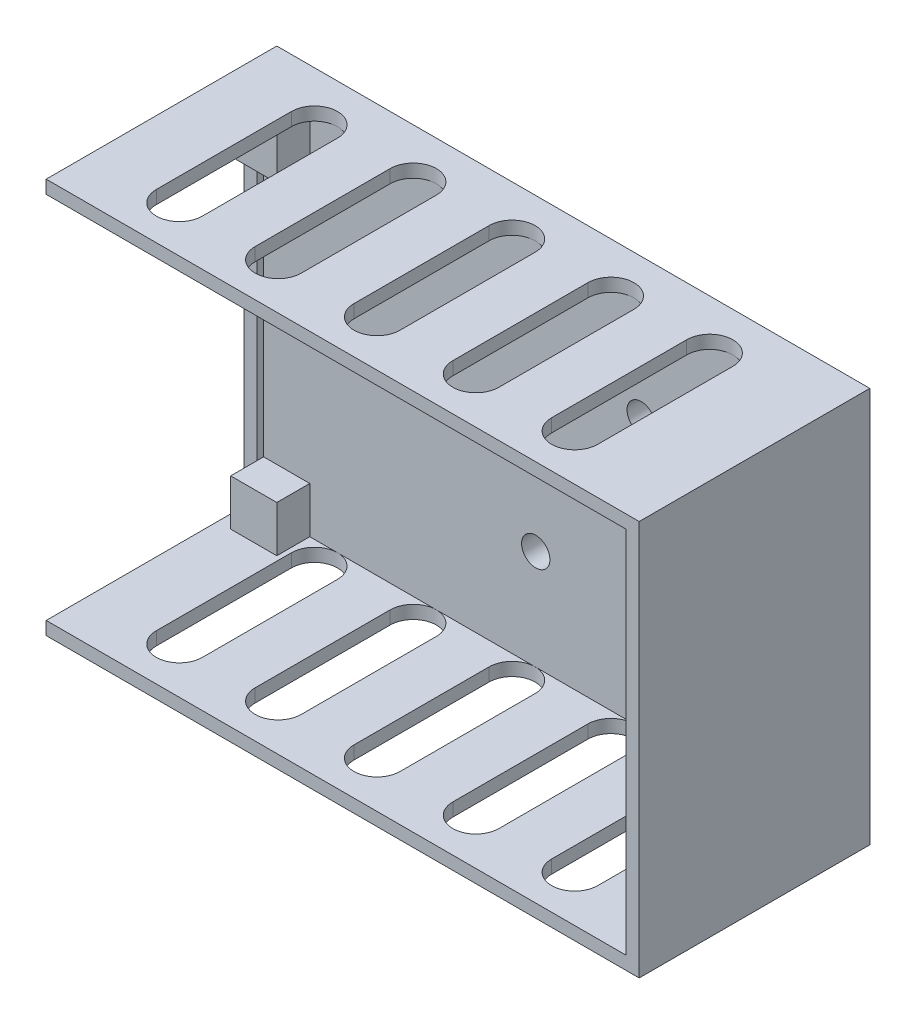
ISO-10303-21;
HEADER;
FILE_DESCRIPTION(('STEP AP214'),'2;1');
FILE_NAME('part.step','',(''),(''),'','','');
FILE_SCHEMA(('AUTOMOTIVE_DESIGN { 1 0 10303 214 1 1 1 1 }'));
ENDSEC;
DATA;
#1=APPLICATION_CONTEXT('core data for automotive mechanical design processes');
#2=APPLICATION_PROTOCOL_DEFINITION('international standard','automotive_design',2000,#1);
#3=PRODUCT_CONTEXT('',#1,'mechanical');
#4=PRODUCT('Part','Part','',(#3));
#5=PRODUCT_RELATED_PRODUCT_CATEGORY('part','',(#4));
#6=PRODUCT_DEFINITION_FORMATION('','',#4);
#7=PRODUCT_DEFINITION_CONTEXT('part definition',#1,'design');
#8=PRODUCT_DEFINITION('design','',#6,#7);
#9=PRODUCT_DEFINITION_SHAPE('','',#8);
#10=(LENGTH_UNIT() NAMED_UNIT(*) SI_UNIT(.MILLI.,.METRE.));
#11=(NAMED_UNIT(*) PLANE_ANGLE_UNIT() SI_UNIT($,.RADIAN.));
#12=(NAMED_UNIT(*) SI_UNIT($,.STERADIAN.) SOLID_ANGLE_UNIT());
#13=UNCERTAINTY_MEASURE_WITH_UNIT(LENGTH_MEASURE(1.E-05),#10,'distance_accuracy_value','');
#14=(GEOMETRIC_REPRESENTATION_CONTEXT(3) GLOBAL_UNCERTAINTY_ASSIGNED_CONTEXT((#13)) GLOBAL_UNIT_ASSIGNED_CONTEXT((#10,
#11,#12)) REPRESENTATION_CONTEXT('',''));
#15=CARTESIAN_POINT('',(0.,0.,0.));
#16=DIRECTION('',(0.,0.,1.));
#17=DIRECTION('',(1.,0.,0.));
#18=AXIS2_PLACEMENT_3D('',#15,#16,#17);
#19=CARTESIAN_POINT('',(0.,0.,4.));
#20=DIRECTION('',(0.,0.,0.999999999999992));
#21=DIRECTION('',(1.00000000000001,0.,0.));
#22=AXIS2_PLACEMENT_3D('',#19,#20,#21);
#23=PLANE('',#22);
#24=CARTESIAN_POINT('',(43.300000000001,-42.8,4.));
#25=DIRECTION('',(0.,0.,0.999999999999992));
#26=DIRECTION('',(1.00000000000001,0.,0.));
#27=AXIS2_PLACEMENT_3D('',#24,#25,#26);
#28=CIRCLE('',#27,2.15);
#29=CARTESIAN_POINT('',(41.150000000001,-42.8,4.));
#30=VERTEX_POINT('',#29);
#31=EDGE_CURVE('E37',#30,#30,#28,.T.);
#32=ORIENTED_EDGE('',*,*,#31,.F.);
#33=EDGE_LOOP('',(#32));
#34=FACE_BOUND('',#33,.T.);
#35=CARTESIAN_POINT('',(59.3,-17.2300000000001,4.));
#36=DIRECTION('',(0.,0.,0.999999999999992));
#37=DIRECTION('',(1.00000000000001,0.,0.));
#38=AXIS2_PLACEMENT_3D('',#35,#36,#37);
#39=CIRCLE('',#38,2.15);
#40=CARTESIAN_POINT('',(57.15,-17.2300000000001,4.));
#41=VERTEX_POINT('',#40);
#42=EDGE_CURVE('E567',#41,#41,#39,.T.);
#43=ORIENTED_EDGE('',*,*,#42,.F.);
#44=EDGE_LOOP('',(#43));
#45=FACE_BOUND('',#44,.T.);
#46=DIRECTION('',(1.00000000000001,0.,0.));
#47=VECTOR('',#46,1.);
#48=CARTESIAN_POINT('',(83.000000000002,-9.,4.));
#49=LINE('',#48,#47);
#50=CARTESIAN_POINT('',(83.000000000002,-9.,4.));
#51=VERTEX_POINT('',#50);
#52=CARTESIAN_POINT('',(88.000000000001,-9.00000000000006,4.));
#53=VERTEX_POINT('',#52);
#54=EDGE_CURVE('E475',#51,#53,#49,.T.);
#55=ORIENTED_EDGE('',*,*,#54,.F.);
#56=DIRECTION('',(0.,-1.00000000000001,0.));
#57=VECTOR('',#56,1.);
#58=CARTESIAN_POINT('',(83.000000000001,-2.,4.));
#59=LINE('',#58,#57);
#60=CARTESIAN_POINT('',(83.000000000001,-2.,4.));
#61=VERTEX_POINT('',#60);
#62=EDGE_CURVE('E479',#61,#51,#59,.T.);
#63=ORIENTED_EDGE('',*,*,#62,.F.);
#64=DIRECTION('',(-1.00000000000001,0.,0.));
#65=VECTOR('',#64,1.);
#66=CARTESIAN_POINT('',(88.000000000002,-2.,4.));
#67=LINE('',#66,#65);
#68=CARTESIAN_POINT('',(73.210480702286,-2.,4.));
#69=VERTEX_POINT('',#68);
#70=EDGE_CURVE('E859',#61,#69,#67,.T.);
#71=ORIENTED_EDGE('',*,*,#70,.T.);
#72=CARTESIAN_POINT('',(58.210480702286,-2.,4.));
#73=VERTEX_POINT('',#72);
#74=EDGE_CURVE('E862',#69,#73,#67,.T.);
#75=ORIENTED_EDGE('',*,*,#74,.T.);
#76=CARTESIAN_POINT('',(43.210480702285,-2.,4.));
#77=VERTEX_POINT('',#76);
#78=EDGE_CURVE('E995',#73,#77,#67,.T.);
#79=ORIENTED_EDGE('',*,*,#78,.T.);
#80=CARTESIAN_POINT('',(28.2104807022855,-2.,4.));
#81=VERTEX_POINT('',#80);
#82=EDGE_CURVE('E996',#77,#81,#67,.T.);
#83=ORIENTED_EDGE('',*,*,#82,.T.);
#84=CARTESIAN_POINT('',(13.2104807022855,-2.,4.));
#85=VERTEX_POINT('',#84);
#86=EDGE_CURVE('E998',#81,#85,#67,.T.);
#87=ORIENTED_EDGE('',*,*,#86,.T.);
#88=CARTESIAN_POINT('',(9.00000000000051,-2.,4.));
#89=VERTEX_POINT('',#88);
#90=EDGE_CURVE('E863',#85,#89,#67,.T.);
#91=ORIENTED_EDGE('',*,*,#90,.T.);
#92=DIRECTION('',(0.,1.00000000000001,0.));
#93=VECTOR('',#92,1.);
#94=CARTESIAN_POINT('',(9.00000000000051,-2.,4.));
#95=LINE('',#94,#93);
#96=CARTESIAN_POINT('',(9.00000000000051,-9.,4.));
#97=VERTEX_POINT('',#96);
#98=EDGE_CURVE('E539',#97,#89,#95,.T.);
#99=ORIENTED_EDGE('',*,*,#98,.F.);
#100=DIRECTION('',(1.00000000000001,0.,0.));
#101=VECTOR('',#100,1.);
#102=CARTESIAN_POINT('',(2.0000000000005,-9.,4.));
#103=LINE('',#102,#101);
#104=CARTESIAN_POINT('',(2.0000000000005,-9.,4.));
#105=VERTEX_POINT('',#104);
#106=EDGE_CURVE('E534',#105,#97,#103,.T.);
#107=ORIENTED_EDGE('',*,*,#106,.F.);
#108=DIRECTION('',(0.,-1.00000000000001,0.));
#109=VECTOR('',#108,1.);
#110=CARTESIAN_POINT('',(2.0000000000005,-2.,4.));
#111=LINE('',#110,#109);
#112=CARTESIAN_POINT('',(2.0000000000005,-51.0000000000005,4.));
#113=VERTEX_POINT('',#112);
#114=EDGE_CURVE('E861',#105,#113,#111,.T.);
#115=ORIENTED_EDGE('',*,*,#114,.T.);
#116=DIRECTION('',(-1.00000000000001,0.,0.));
#117=VECTOR('',#116,1.);
#118=CARTESIAN_POINT('',(2.0000000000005,-51.0000000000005,4.));
#119=LINE('',#118,#117);
#120=CARTESIAN_POINT('',(9.00000000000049,-51.0000000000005,4.));
#121=VERTEX_POINT('',#120);
#122=EDGE_CURVE('E510',#121,#113,#119,.T.);
#123=ORIENTED_EDGE('',*,*,#122,.F.);
#124=DIRECTION('',(0.,1.00000000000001,0.));
#125=VECTOR('',#124,1.);
#126=CARTESIAN_POINT('',(9.00000000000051,-58.0000000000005,4.));
#127=LINE('',#126,#125);
#128=CARTESIAN_POINT('',(9.00000000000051,-58.0000000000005,4.));
#129=VERTEX_POINT('',#128);
#130=EDGE_CURVE('E505',#129,#121,#127,.T.);
#131=ORIENTED_EDGE('',*,*,#130,.F.);
#132=DIRECTION('',(1.00000000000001,0.,0.));
#133=VECTOR('',#132,1.);
#134=CARTESIAN_POINT('',(2.0000000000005,-58.0000000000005,4.));
#135=LINE('',#134,#133);
#136=CARTESIAN_POINT('',(13.2104807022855,-58.,4.));
#137=VERTEX_POINT('',#136);
#138=EDGE_CURVE('E867',#129,#137,#135,.T.);
#139=ORIENTED_EDGE('',*,*,#138,.T.);
#140=CARTESIAN_POINT('',(28.2104807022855,-58.0000000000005,4.));
#141=VERTEX_POINT('',#140);
#142=EDGE_CURVE('E870',#137,#141,#135,.T.);
#143=ORIENTED_EDGE('',*,*,#142,.T.);
#144=CARTESIAN_POINT('',(43.2104807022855,-58.0000000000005,4.));
#145=VERTEX_POINT('',#144);
#146=EDGE_CURVE('E1046',#141,#145,#135,.T.);
#147=ORIENTED_EDGE('',*,*,#146,.T.);
#148=CARTESIAN_POINT('',(58.210480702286,-58.,4.));
#149=VERTEX_POINT('',#148);
#150=EDGE_CURVE('E1047',#145,#149,#135,.T.);
#151=ORIENTED_EDGE('',*,*,#150,.T.);
#152=CARTESIAN_POINT('',(73.210480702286,-58.0000000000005,4.));
#153=VERTEX_POINT('',#152);
#154=EDGE_CURVE('E1049',#149,#153,#135,.T.);
#155=ORIENTED_EDGE('',*,*,#154,.T.);
#156=CARTESIAN_POINT('',(81.000000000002,-58.,4.));
#157=VERTEX_POINT('',#156);
#158=EDGE_CURVE('E866',#153,#157,#135,.T.);
#159=ORIENTED_EDGE('',*,*,#158,.T.);
#160=DIRECTION('',(0.,-1.00000000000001,0.));
#161=VECTOR('',#160,1.);
#162=CARTESIAN_POINT('',(81.000000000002,-51.,4.));
#163=LINE('',#162,#161);
#164=CARTESIAN_POINT('',(81.000000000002,-51.,4.));
#165=VERTEX_POINT('',#164);
#166=EDGE_CURVE('E481',#165,#157,#163,.T.);
#167=ORIENTED_EDGE('',*,*,#166,.F.);
#168=DIRECTION('',(-1.00000000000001,0.,0.));
#169=VECTOR('',#168,1.);
#170=CARTESIAN_POINT('',(81.000000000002,-51.,4.));
#171=LINE('',#170,#169);
#172=CARTESIAN_POINT('',(88.000000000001,-51.,4.));
#173=VERTEX_POINT('',#172);
#174=EDGE_CURVE('E483',#173,#165,#171,.T.);
#175=ORIENTED_EDGE('',*,*,#174,.F.);
#176=DIRECTION('',(0.,1.00000000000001,0.));
#177=VECTOR('',#176,1.);
#178=CARTESIAN_POINT('',(88.000000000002,-58.,4.));
#179=LINE('',#178,#177);
#180=EDGE_CURVE('E869',#173,#53,#179,.T.);
#181=ORIENTED_EDGE('',*,*,#180,.T.);
#182=EDGE_LOOP('',(#55,#63,#71,#75,#79,#83,#87,#91,#99,#107,#115,#123,#131,#139,#143,#147,#151,
#155,#159,#167,#175,#181));
#183=FACE_BOUND('',#182,.T.);
#184=ADVANCED_FACE('F33',(#34,#45,#183),#23,.T.);
#185=CARTESIAN_POINT('',(88.000000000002,-58.,4.));
#186=DIRECTION('',(1.00000000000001,0.,0.));
#187=DIRECTION('',(0.,1.00000000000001,0.));
#188=AXIS2_PLACEMENT_3D('',#185,#186,#187);
#189=PLANE('',#188);
#190=DIRECTION('',(0.,0.,-0.999999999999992));
#191=VECTOR('',#190,1.);
#192=CARTESIAN_POINT('',(88.000000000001,-9.00000000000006,9.));
#193=LINE('',#192,#191);
#194=CARTESIAN_POINT('',(88.000000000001,-9.00000000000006,9.));
#195=VERTEX_POINT('',#194);
#196=EDGE_CURVE('E467',#195,#53,#193,.T.);
#197=ORIENTED_EDGE('',*,*,#196,.T.);
#198=ORIENTED_EDGE('',*,*,#180,.F.);
#199=DIRECTION('',(0.,0.,-0.999999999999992));
#200=VECTOR('',#199,1.);
#201=CARTESIAN_POINT('',(88.000000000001,-51.,9.));
#202=LINE('',#201,#200);
#203=CARTESIAN_POINT('',(88.000000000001,-51.,9.));
#204=VERTEX_POINT('',#203);
#205=EDGE_CURVE('E500',#204,#173,#202,.T.);
#206=ORIENTED_EDGE('',*,*,#205,.F.);
#207=DIRECTION('',(0.,1.00000000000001,0.));
#208=VECTOR('',#207,1.);
#209=CARTESIAN_POINT('',(88.000000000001,-51.,9.));
#210=LINE('',#209,#208);
#211=CARTESIAN_POINT('',(88.000000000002,-58.,9.));
#212=VERTEX_POINT('',#211);
#213=EDGE_CURVE('E492',#212,#204,#210,.T.);
#214=ORIENTED_EDGE('',*,*,#213,.F.);
#215=DIRECTION('',(0.,0.,0.999999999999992));
#216=VECTOR('',#215,1.);
#217=CARTESIAN_POINT('',(88.000000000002,-58.,4.));
#218=LINE('',#217,#216);
#219=CARTESIAN_POINT('',(88.000000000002,-58.,34.9999999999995));
#220=VERTEX_POINT('',#219);
#221=EDGE_CURVE('E873',#212,#220,#218,.T.);
#222=ORIENTED_EDGE('',*,*,#221,.T.);
#223=DIRECTION('',(0.,1.00000000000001,0.));
#224=VECTOR('',#223,1.);
#225=CARTESIAN_POINT('',(88.000000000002,-58.,34.9999999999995));
#226=LINE('',#225,#224);
#227=CARTESIAN_POINT('',(88.000000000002,-2.,34.9999999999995));
#228=VERTEX_POINT('',#227);
#229=EDGE_CURVE('E878',#220,#228,#226,.T.);
#230=ORIENTED_EDGE('',*,*,#229,.T.);
#231=DIRECTION('',(0.,0.,0.999999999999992));
#232=VECTOR('',#231,1.);
#233=CARTESIAN_POINT('',(88.000000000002,-2.,4.));
#234=LINE('',#233,#232);
#235=CARTESIAN_POINT('',(88.000000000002,-2.,9.));
#236=VERTEX_POINT('',#235);
#237=EDGE_CURVE('E881',#236,#228,#234,.T.);
#238=ORIENTED_EDGE('',*,*,#237,.F.);
#239=DIRECTION('',(0.,1.00000000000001,0.));
#240=VECTOR('',#239,1.);
#241=CARTESIAN_POINT('',(88.000000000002,-2.,9.));
#242=LINE('',#241,#240);
#243=EDGE_CURVE('E51',#195,#236,#242,.T.);
#244=ORIENTED_EDGE('',*,*,#243,.F.);
#245=EDGE_LOOP('',(#197,#198,#206,#214,#222,#230,#238,#244));
#246=FACE_BOUND('',#245,.T.);
#247=ADVANCED_FACE('F970',(#246),#189,.F.);
#248=CARTESIAN_POINT('',(88.000000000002,-2.,4.));
#249=DIRECTION('',(0.,1.00000000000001,0.));
#250=DIRECTION('',(0.,0.,0.999999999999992));
#251=AXIS2_PLACEMENT_3D('',#248,#249,#250);
#252=PLANE('',#251);
#253=DIRECTION('',(0.,0.,-0.999999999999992));
#254=VECTOR('',#253,1.);
#255=CARTESIAN_POINT('',(83.000000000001,-2.,9.));
#256=LINE('',#255,#254);
#257=CARTESIAN_POINT('',(83.000000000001,-2.,9.));
#258=VERTEX_POINT('',#257);
#259=EDGE_CURVE('E485',#258,#61,#256,.T.);
#260=ORIENTED_EDGE('',*,*,#259,.F.);
#261=DIRECTION('',(-1.00000000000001,0.,0.));
#262=VECTOR('',#261,1.);
#263=CARTESIAN_POINT('',(83.000000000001,-2.,9.));
#264=LINE('',#263,#262);
#265=EDGE_CURVE('E472',#236,#258,#264,.T.);
#266=ORIENTED_EDGE('',*,*,#265,.F.);
#267=ORIENTED_EDGE('',*,*,#237,.T.);
#268=DIRECTION('',(-1.00000000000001,0.,0.));
#269=VECTOR('',#268,1.);
#270=CARTESIAN_POINT('',(88.000000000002,-2.,34.9999999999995));
#271=LINE('',#270,#269);
#272=CARTESIAN_POINT('',(0.,-2.,34.9999999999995));
#273=VERTEX_POINT('',#272);
#274=EDGE_CURVE('E858',#228,#273,#271,.T.);
#275=ORIENTED_EDGE('',*,*,#274,.T.);
#276=DIRECTION('',(0.,0.,-0.999999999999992));
#277=VECTOR('',#276,1.);
#278=CARTESIAN_POINT('',(0.,-2.,34.9999999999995));
#279=LINE('',#278,#277);
#280=CARTESIAN_POINT('',(0.,-2.00000000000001,5.));
#281=VERTEX_POINT('',#280);
#282=EDGE_CURVE('E570',#273,#281,#279,.T.);
#283=ORIENTED_EDGE('',*,*,#282,.T.);
#284=DIRECTION('',(-1.00000000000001,0.,0.));
#285=VECTOR('',#284,1.);
#286=CARTESIAN_POINT('',(3.0000000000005,-2.00000000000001,5.));
#287=LINE('',#286,#285);
#288=CARTESIAN_POINT('',(2.0000000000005,-2.,5.));
#289=VERTEX_POINT('',#288);
#290=EDGE_CURVE('E579',#289,#281,#287,.T.);
#291=ORIENTED_EDGE('',*,*,#290,.F.);
#292=DIRECTION('',(0.,0.,-0.999999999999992));
#293=VECTOR('',#292,1.);
#294=CARTESIAN_POINT('',(2.0000000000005,-2.,9.));
#295=LINE('',#294,#293);
#296=CARTESIAN_POINT('',(2.0000000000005,-2.,9.));
#297=VERTEX_POINT('',#296);
#298=EDGE_CURVE('E547',#297,#289,#295,.T.);
#299=ORIENTED_EDGE('',*,*,#298,.F.);
#300=DIRECTION('',(-1.00000000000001,0.,0.));
#301=VECTOR('',#300,1.);
#302=CARTESIAN_POINT('',(2.0000000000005,-2.,9.));
#303=LINE('',#302,#301);
#304=CARTESIAN_POINT('',(9.00000000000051,-2.,9.));
#305=VERTEX_POINT('',#304);
#306=EDGE_CURVE('E544',#305,#297,#303,.T.);
#307=ORIENTED_EDGE('',*,*,#306,.F.);
#308=DIRECTION('',(0.,0.,-0.999999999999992));
#309=VECTOR('',#308,1.);
#310=CARTESIAN_POINT('',(9.00000000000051,-2.,9.));
#311=LINE('',#310,#309);
#312=EDGE_CURVE('E554',#305,#89,#311,.T.);
#313=ORIENTED_EDGE('',*,*,#312,.T.);
#314=ORIENTED_EDGE('',*,*,#90,.F.);
#315=CARTESIAN_POINT('',(13.2104807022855,-2.,7.5));
#316=DIRECTION('',(0.,1.00000000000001,0.));
#317=DIRECTION('',(0.,0.,0.999999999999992));
#318=AXIS2_PLACEMENT_3D('',#315,#316,#317);
#319=CIRCLE('',#318,3.5);
#320=CARTESIAN_POINT('',(9.7104807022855,-2.,7.5));
#321=VERTEX_POINT('',#320);
#322=EDGE_CURVE('E808',#85,#321,#319,.T.);
#323=ORIENTED_EDGE('',*,*,#322,.T.);
#324=DIRECTION('',(0.,0.,0.999999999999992));
#325=VECTOR('',#324,1.);
#326=CARTESIAN_POINT('',(9.7104807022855,-2.,4.));
#327=LINE('',#326,#325);
#328=CARTESIAN_POINT('',(9.7104807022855,-2.,27.9999999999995));
#329=VERTEX_POINT('',#328);
#330=EDGE_CURVE('E849',#321,#329,#327,.T.);
#331=ORIENTED_EDGE('',*,*,#330,.T.);
#332=CARTESIAN_POINT('',(13.2104807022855,-2.,27.9999999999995));
#333=DIRECTION('',(0.,1.00000000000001,0.));
#334=DIRECTION('',(0.,0.,0.999999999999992));
#335=AXIS2_PLACEMENT_3D('',#332,#333,#334);
#336=CIRCLE('',#335,3.50000000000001);
#337=CARTESIAN_POINT('',(16.7104807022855,-2.,27.9999999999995));
#338=VERTEX_POINT('',#337);
#339=EDGE_CURVE('E852',#329,#338,#336,.T.);
#340=ORIENTED_EDGE('',*,*,#339,.T.);
#341=DIRECTION('',(0.,0.,-0.999999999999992));
#342=VECTOR('',#341,1.);
#343=CARTESIAN_POINT('',(16.7104807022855,-2.,4.00000000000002));
#344=LINE('',#343,#342);
#345=CARTESIAN_POINT('',(16.7104807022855,-2.,7.5));
#346=VERTEX_POINT('',#345);
#347=EDGE_CURVE('E855',#338,#346,#344,.T.);
#348=ORIENTED_EDGE('',*,*,#347,.T.);
#349=EDGE_CURVE('E812',#346,#85,#319,.T.);
#350=ORIENTED_EDGE('',*,*,#349,.T.);
#351=ORIENTED_EDGE('',*,*,#86,.F.);
#352=CARTESIAN_POINT('',(28.2104807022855,-2.,7.5));
#353=DIRECTION('',(0.,1.00000000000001,0.));
#354=DIRECTION('',(0.,0.,0.999999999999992));
#355=AXIS2_PLACEMENT_3D('',#352,#353,#354);
#356=CIRCLE('',#355,3.5);
#357=CARTESIAN_POINT('',(24.7104807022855,-2.,7.5));
#358=VERTEX_POINT('',#357);
#359=EDGE_CURVE('E800',#81,#358,#356,.T.);
#360=ORIENTED_EDGE('',*,*,#359,.T.);
#361=DIRECTION('',(0.,0.,0.999999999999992));
#362=VECTOR('',#361,1.);
#363=CARTESIAN_POINT('',(24.7104807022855,-2.,4.00000000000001));
#364=LINE('',#363,#362);
#365=CARTESIAN_POINT('',(24.7104807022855,-2.,27.9999999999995));
#366=VERTEX_POINT('',#365);
#367=EDGE_CURVE('E840',#358,#366,#364,.T.);
#368=ORIENTED_EDGE('',*,*,#367,.T.);
#369=CARTESIAN_POINT('',(28.2104807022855,-2.,27.9999999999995));
#370=DIRECTION('',(0.,1.00000000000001,0.));
#371=DIRECTION('',(0.,0.,0.999999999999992));
#372=AXIS2_PLACEMENT_3D('',#369,#370,#371);
#373=CIRCLE('',#372,3.5);
#374=CARTESIAN_POINT('',(31.710480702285,-2.,27.9999999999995));
#375=VERTEX_POINT('',#374);
#376=EDGE_CURVE('E843',#366,#375,#373,.T.);
#377=ORIENTED_EDGE('',*,*,#376,.T.);
#378=DIRECTION('',(0.,0.,-0.999999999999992));
#379=VECTOR('',#378,1.);
#380=CARTESIAN_POINT('',(31.710480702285,-2.,4.00000000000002));
#381=LINE('',#380,#379);
#382=CARTESIAN_POINT('',(31.710480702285,-2.,7.5));
#383=VERTEX_POINT('',#382);
#384=EDGE_CURVE('E846',#375,#383,#381,.T.);
#385=ORIENTED_EDGE('',*,*,#384,.T.);
#386=EDGE_CURVE('E804',#383,#81,#356,.T.);
#387=ORIENTED_EDGE('',*,*,#386,.T.);
#388=ORIENTED_EDGE('',*,*,#82,.F.);
#389=CARTESIAN_POINT('',(43.210480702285,-2.,7.5));
#390=DIRECTION('',(0.,1.00000000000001,0.));
#391=DIRECTION('',(0.,0.,0.999999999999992));
#392=AXIS2_PLACEMENT_3D('',#389,#390,#391);
#393=CIRCLE('',#392,3.5);
#394=CARTESIAN_POINT('',(39.710480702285,-2.,7.5));
#395=VERTEX_POINT('',#394);
#396=EDGE_CURVE('E792',#77,#395,#393,.T.);
#397=ORIENTED_EDGE('',*,*,#396,.T.);
#398=DIRECTION('',(0.,0.,0.999999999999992));
#399=VECTOR('',#398,1.);
#400=CARTESIAN_POINT('',(39.710480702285,-2.,4.00000000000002));
#401=LINE('',#400,#399);
#402=CARTESIAN_POINT('',(39.710480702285,-2.,27.9999999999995));
#403=VERTEX_POINT('',#402);
#404=EDGE_CURVE('E831',#395,#403,#401,.T.);
#405=ORIENTED_EDGE('',*,*,#404,.T.);
#406=CARTESIAN_POINT('',(43.210480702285,-2.,27.9999999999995));
#407=DIRECTION('',(0.,1.00000000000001,0.));
#408=DIRECTION('',(0.,0.,0.999999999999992));
#409=AXIS2_PLACEMENT_3D('',#406,#407,#408);
#410=CIRCLE('',#409,3.5);
#411=CARTESIAN_POINT('',(46.710480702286,-2.,27.9999999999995));
#412=VERTEX_POINT('',#411);
#413=EDGE_CURVE('E834',#403,#412,#410,.T.);
#414=ORIENTED_EDGE('',*,*,#413,.T.);
#415=DIRECTION('',(0.,0.,-0.999999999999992));
#416=VECTOR('',#415,1.);
#417=CARTESIAN_POINT('',(46.710480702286,-2.,4.00000000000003));
#418=LINE('',#417,#416);
#419=CARTESIAN_POINT('',(46.710480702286,-2.,7.5));
#420=VERTEX_POINT('',#419);
#421=EDGE_CURVE('E837',#412,#420,#418,.T.);
#422=ORIENTED_EDGE('',*,*,#421,.T.);
#423=EDGE_CURVE('E796',#420,#77,#393,.T.);
#424=ORIENTED_EDGE('',*,*,#423,.T.);
#425=ORIENTED_EDGE('',*,*,#78,.F.);
#426=CARTESIAN_POINT('',(58.210480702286,-2.,7.5));
#427=DIRECTION('',(0.,1.00000000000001,0.));
#428=DIRECTION('',(0.,0.,0.999999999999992));
#429=AXIS2_PLACEMENT_3D('',#426,#427,#428);
#430=CIRCLE('',#429,3.5);
#431=CARTESIAN_POINT('',(54.710480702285,-2.,7.5));
#432=VERTEX_POINT('',#431);
#433=EDGE_CURVE('E784',#73,#432,#430,.T.);
#434=ORIENTED_EDGE('',*,*,#433,.T.);
#435=DIRECTION('',(0.,0.,0.999999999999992));
#436=VECTOR('',#435,1.);
#437=CARTESIAN_POINT('',(54.710480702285,-2.,4.00000000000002));
#438=LINE('',#437,#436);
#439=CARTESIAN_POINT('',(54.710480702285,-2.,27.9999999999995));
#440=VERTEX_POINT('',#439);
#441=EDGE_CURVE('E822',#432,#440,#438,.T.);
#442=ORIENTED_EDGE('',*,*,#441,.T.);
#443=CARTESIAN_POINT('',(58.210480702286,-2.,27.9999999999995));
#444=DIRECTION('',(0.,1.00000000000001,0.));
#445=DIRECTION('',(0.,0.,0.999999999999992));
#446=AXIS2_PLACEMENT_3D('',#443,#444,#445);
#447=CIRCLE('',#446,3.5);
#448=CARTESIAN_POINT('',(61.710480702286,-2.,27.9999999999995));
#449=VERTEX_POINT('',#448);
#450=EDGE_CURVE('E825',#440,#449,#447,.T.);
#451=ORIENTED_EDGE('',*,*,#450,.T.);
#452=DIRECTION('',(0.,0.,-0.999999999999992));
#453=VECTOR('',#452,1.);
#454=CARTESIAN_POINT('',(61.710480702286,-2.,4.00000000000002));
#455=LINE('',#454,#453);
#456=CARTESIAN_POINT('',(61.710480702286,-2.,7.5));
#457=VERTEX_POINT('',#456);
#458=EDGE_CURVE('E828',#449,#457,#455,.T.);
#459=ORIENTED_EDGE('',*,*,#458,.T.);
#460=EDGE_CURVE('E788',#457,#73,#430,.T.);
#461=ORIENTED_EDGE('',*,*,#460,.T.);
#462=ORIENTED_EDGE('',*,*,#74,.F.);
#463=CARTESIAN_POINT('',(73.210480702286,-2.,7.5));
#464=DIRECTION('',(0.,1.00000000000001,0.));
#465=DIRECTION('',(0.,0.,0.999999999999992));
#466=AXIS2_PLACEMENT_3D('',#463,#464,#465);
#467=CIRCLE('',#466,3.5);
#468=CARTESIAN_POINT('',(69.710480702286,-2.,7.5));
#469=VERTEX_POINT('',#468);
#470=EDGE_CURVE('E776',#69,#469,#467,.T.);
#471=ORIENTED_EDGE('',*,*,#470,.T.);
#472=DIRECTION('',(0.,0.,0.999999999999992));
#473=VECTOR('',#472,1.);
#474=CARTESIAN_POINT('',(69.710480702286,-2.,4.00000000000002));
#475=LINE('',#474,#473);
#476=CARTESIAN_POINT('',(69.710480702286,-2.,27.9999999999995));
#477=VERTEX_POINT('',#476);
#478=EDGE_CURVE('E813',#469,#477,#475,.T.);
#479=ORIENTED_EDGE('',*,*,#478,.T.);
#480=CARTESIAN_POINT('',(73.210480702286,-2.,27.9999999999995));
#481=DIRECTION('',(0.,1.00000000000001,0.));
#482=DIRECTION('',(0.,0.,0.999999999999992));
#483=AXIS2_PLACEMENT_3D('',#480,#481,#482);
#484=CIRCLE('',#483,3.5);
#485=CARTESIAN_POINT('',(76.710480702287,-2.,27.9999999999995));
#486=VERTEX_POINT('',#485);
#487=EDGE_CURVE('E816',#477,#486,#484,.T.);
#488=ORIENTED_EDGE('',*,*,#487,.T.);
#489=DIRECTION('',(0.,0.,-0.999999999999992));
#490=VECTOR('',#489,1.);
#491=CARTESIAN_POINT('',(76.710480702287,-2.,4.00000000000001));
#492=LINE('',#491,#490);
#493=CARTESIAN_POINT('',(76.710480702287,-2.,7.5));
#494=VERTEX_POINT('',#493);
#495=EDGE_CURVE('E819',#486,#494,#492,.T.);
#496=ORIENTED_EDGE('',*,*,#495,.T.);
#497=EDGE_CURVE('E780',#494,#69,#467,.T.);
#498=ORIENTED_EDGE('',*,*,#497,.T.);
#499=ORIENTED_EDGE('',*,*,#70,.F.);
#500=EDGE_LOOP('',(#260,#266,#267,#275,#283,#291,#299,#307,#313,#314,#323,#331,#340,#348,#350,
#351,#360,#368,#377,#385,#387,#388,#397,#405,#414,#422,#424,#425,#434,#442,#451,#459,#461,#462,
#471,#479,#488,#496,#498,#499));
#501=FACE_BOUND('',#500,.T.);
#502=ADVANCED_FACE('F981',(#501),#252,.F.);
#503=CARTESIAN_POINT('',(2.0000000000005,-58.0000000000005,4.));
#504=DIRECTION('',(0.,-1.00000000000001,0.));
#505=DIRECTION('',(0.,0.,-0.999999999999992));
#506=AXIS2_PLACEMENT_3D('',#503,#504,#505);
#507=PLANE('',#506);
#508=DIRECTION('',(0.,0.,-0.999999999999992));
#509=VECTOR('',#508,1.);
#510=CARTESIAN_POINT('',(81.000000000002,-58.,9.));
#511=LINE('',#510,#509);
#512=CARTESIAN_POINT('',(81.000000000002,-58.,9.));
#513=VERTEX_POINT('',#512);
#514=EDGE_CURVE('E502',#513,#157,#511,.T.);
#515=ORIENTED_EDGE('',*,*,#514,.T.);
#516=ORIENTED_EDGE('',*,*,#158,.F.);
#517=CARTESIAN_POINT('',(73.210480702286,-58.0000000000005,7.5));
#518=DIRECTION('',(0.,-1.00000000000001,0.));
#519=DIRECTION('',(0.,0.,-0.999999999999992));
#520=AXIS2_PLACEMENT_3D('',#517,#518,#519);
#521=CIRCLE('',#520,3.5);
#522=CARTESIAN_POINT('',(76.710480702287,-58.0000000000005,7.5));
#523=VERTEX_POINT('',#522);
#524=EDGE_CURVE('E612',#153,#523,#521,.T.);
#525=ORIENTED_EDGE('',*,*,#524,.T.);
#526=DIRECTION('',(0.,0.,0.999999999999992));
#527=VECTOR('',#526,1.);
#528=CARTESIAN_POINT('',(76.710480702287,-58.0000000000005,3.99999999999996));
#529=LINE('',#528,#527);
#530=CARTESIAN_POINT('',(76.710480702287,-58.0000000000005,27.9999999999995));
#531=VERTEX_POINT('',#530);
#532=EDGE_CURVE('E921',#523,#531,#529,.T.);
#533=ORIENTED_EDGE('',*,*,#532,.T.);
#534=CARTESIAN_POINT('',(73.210480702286,-58.0000000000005,27.9999999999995));
#535=DIRECTION('',(0.,-1.00000000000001,0.));
#536=DIRECTION('',(0.,0.,-0.999999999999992));
#537=AXIS2_PLACEMENT_3D('',#534,#535,#536);
#538=CIRCLE('',#537,3.5);
#539=CARTESIAN_POINT('',(69.710480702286,-58.0000000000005,27.9999999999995));
#540=VERTEX_POINT('',#539);
#541=EDGE_CURVE('E918',#531,#540,#538,.T.);
#542=ORIENTED_EDGE('',*,*,#541,.T.);
#543=DIRECTION('',(0.,0.,-0.999999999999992));
#544=VECTOR('',#543,1.);
#545=CARTESIAN_POINT('',(69.710480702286,-58.0000000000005,3.99999999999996));
#546=LINE('',#545,#544);
#547=CARTESIAN_POINT('',(69.710480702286,-58.0000000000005,7.5));
#548=VERTEX_POINT('',#547);
#549=EDGE_CURVE('E915',#540,#548,#546,.T.);
#550=ORIENTED_EDGE('',*,*,#549,.T.);
#551=EDGE_CURVE('E777',#548,#153,#521,.T.);
#552=ORIENTED_EDGE('',*,*,#551,.T.);
#553=ORIENTED_EDGE('',*,*,#154,.F.);
#554=CARTESIAN_POINT('',(58.210480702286,-58.,7.5));
#555=DIRECTION('',(0.,-1.00000000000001,0.));
#556=DIRECTION('',(0.,0.,-0.999999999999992));
#557=AXIS2_PLACEMENT_3D('',#554,#555,#556);
#558=CIRCLE('',#557,3.5);
#559=CARTESIAN_POINT('',(61.710480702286,-58.,7.5));
#560=VERTEX_POINT('',#559);
#561=EDGE_CURVE('E781',#149,#560,#558,.T.);
#562=ORIENTED_EDGE('',*,*,#561,.T.);
#563=DIRECTION('',(0.,0.,0.999999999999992));
#564=VECTOR('',#563,1.);
#565=CARTESIAN_POINT('',(61.710480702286,-58.,3.99999999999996));
#566=LINE('',#565,#564);
#567=CARTESIAN_POINT('',(61.710480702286,-58.,27.9999999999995));
#568=VERTEX_POINT('',#567);
#569=EDGE_CURVE('E930',#560,#568,#566,.T.);
#570=ORIENTED_EDGE('',*,*,#569,.T.);
#571=CARTESIAN_POINT('',(58.210480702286,-58.,27.9999999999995));
#572=DIRECTION('',(0.,-1.00000000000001,0.));
#573=DIRECTION('',(0.,0.,-0.999999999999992));
#574=AXIS2_PLACEMENT_3D('',#571,#572,#573);
#575=CIRCLE('',#574,3.5);
#576=CARTESIAN_POINT('',(54.710480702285,-58.,27.9999999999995));
#577=VERTEX_POINT('',#576);
#578=EDGE_CURVE('E927',#568,#577,#575,.T.);
#579=ORIENTED_EDGE('',*,*,#578,.T.);
#580=DIRECTION('',(0.,0.,-0.999999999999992));
#581=VECTOR('',#580,1.);
#582=CARTESIAN_POINT('',(54.710480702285,-58.,3.99999999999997));
#583=LINE('',#582,#581);
#584=CARTESIAN_POINT('',(54.710480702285,-58.,7.5));
#585=VERTEX_POINT('',#584);
#586=EDGE_CURVE('E924',#577,#585,#583,.T.);
#587=ORIENTED_EDGE('',*,*,#586,.T.);
#588=EDGE_CURVE('E785',#585,#149,#558,.T.);
#589=ORIENTED_EDGE('',*,*,#588,.T.);
#590=ORIENTED_EDGE('',*,*,#150,.F.);
#591=CARTESIAN_POINT('',(43.2104807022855,-58.0000000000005,7.5));
#592=DIRECTION('',(0.,-1.00000000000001,0.));
#593=DIRECTION('',(0.,0.,-0.999999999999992));
#594=AXIS2_PLACEMENT_3D('',#591,#592,#593);
#595=CIRCLE('',#594,3.5);
#596=CARTESIAN_POINT('',(46.710480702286,-58.0000000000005,7.5));
#597=VERTEX_POINT('',#596);
#598=EDGE_CURVE('E789',#145,#597,#595,.T.);
#599=ORIENTED_EDGE('',*,*,#598,.T.);
#600=DIRECTION('',(0.,0.,0.999999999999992));
#601=VECTOR('',#600,1.);
#602=CARTESIAN_POINT('',(46.710480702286,-58.0000000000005,3.99999999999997));
#603=LINE('',#602,#601);
#604=CARTESIAN_POINT('',(46.710480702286,-58.0000000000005,27.9999999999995));
#605=VERTEX_POINT('',#604);
#606=EDGE_CURVE('E939',#597,#605,#603,.T.);
#607=ORIENTED_EDGE('',*,*,#606,.T.);
#608=CARTESIAN_POINT('',(43.2104807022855,-58.0000000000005,27.9999999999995));
#609=DIRECTION('',(0.,-1.00000000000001,0.));
#610=DIRECTION('',(0.,0.,-0.999999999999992));
#611=AXIS2_PLACEMENT_3D('',#608,#609,#610);
#612=CIRCLE('',#611,3.5);
#613=CARTESIAN_POINT('',(39.710480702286,-58.0000000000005,27.9999999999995));
#614=VERTEX_POINT('',#613);
#615=EDGE_CURVE('E936',#605,#614,#612,.T.);
#616=ORIENTED_EDGE('',*,*,#615,.T.);
#617=DIRECTION('',(0.,0.,-0.999999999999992));
#618=VECTOR('',#617,1.);
#619=CARTESIAN_POINT('',(39.710480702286,-58.0000000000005,3.99999999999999));
#620=LINE('',#619,#618);
#621=CARTESIAN_POINT('',(39.710480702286,-58.0000000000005,7.5));
#622=VERTEX_POINT('',#621);
#623=EDGE_CURVE('E933',#614,#622,#620,.T.);
#624=ORIENTED_EDGE('',*,*,#623,.T.);
#625=EDGE_CURVE('E793',#622,#145,#595,.T.);
#626=ORIENTED_EDGE('',*,*,#625,.T.);
#627=ORIENTED_EDGE('',*,*,#146,.F.);
#628=CARTESIAN_POINT('',(28.2104807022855,-58.0000000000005,7.5));
#629=DIRECTION('',(0.,-1.00000000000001,0.));
#630=DIRECTION('',(0.,0.,-0.999999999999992));
#631=AXIS2_PLACEMENT_3D('',#628,#629,#630);
#632=CIRCLE('',#631,3.5);
#633=CARTESIAN_POINT('',(31.710480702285,-58.0000000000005,7.5));
#634=VERTEX_POINT('',#633);
#635=EDGE_CURVE('E797',#141,#634,#632,.T.);
#636=ORIENTED_EDGE('',*,*,#635,.T.);
#637=DIRECTION('',(0.,0.,0.999999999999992));
#638=VECTOR('',#637,1.);
#639=CARTESIAN_POINT('',(31.710480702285,-58.0000000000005,3.99999999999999));
#640=LINE('',#639,#638);
#641=CARTESIAN_POINT('',(31.710480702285,-58.0000000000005,27.9999999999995));
#642=VERTEX_POINT('',#641);
#643=EDGE_CURVE('E948',#634,#642,#640,.T.);
#644=ORIENTED_EDGE('',*,*,#643,.T.);
#645=CARTESIAN_POINT('',(28.2104807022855,-58.0000000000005,27.9999999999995));
#646=DIRECTION('',(0.,-1.00000000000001,0.));
#647=DIRECTION('',(0.,0.,-0.999999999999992));
#648=AXIS2_PLACEMENT_3D('',#645,#646,#647);
#649=CIRCLE('',#648,3.5);
#650=CARTESIAN_POINT('',(24.710480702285,-58.0000000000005,27.9999999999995));
#651=VERTEX_POINT('',#650);
#652=EDGE_CURVE('E945',#642,#651,#649,.T.);
#653=ORIENTED_EDGE('',*,*,#652,.T.);
#654=DIRECTION('',(0.,0.,-0.999999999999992));
#655=VECTOR('',#654,1.);
#656=CARTESIAN_POINT('',(24.710480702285,-58.0000000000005,4.));
#657=LINE('',#656,#655);
#658=CARTESIAN_POINT('',(24.710480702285,-58.0000000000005,7.5));
#659=VERTEX_POINT('',#658);
#660=EDGE_CURVE('E942',#651,#659,#657,.T.);
#661=ORIENTED_EDGE('',*,*,#660,.T.);
#662=EDGE_CURVE('E801',#659,#141,#632,.T.);
#663=ORIENTED_EDGE('',*,*,#662,.T.);
#664=ORIENTED_EDGE('',*,*,#142,.F.);
#665=CARTESIAN_POINT('',(13.2104807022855,-58.,7.5));
#666=DIRECTION('',(0.,-1.00000000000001,0.));
#667=DIRECTION('',(0.,0.,-0.999999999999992));
#668=AXIS2_PLACEMENT_3D('',#665,#666,#667);
#669=CIRCLE('',#668,3.5);
#670=CARTESIAN_POINT('',(16.710480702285,-58.,7.5));
#671=VERTEX_POINT('',#670);
#672=EDGE_CURVE('E805',#137,#671,#669,.T.);
#673=ORIENTED_EDGE('',*,*,#672,.T.);
#674=DIRECTION('',(0.,0.,0.999999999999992));
#675=VECTOR('',#674,1.);
#676=CARTESIAN_POINT('',(16.710480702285,-58.,4.));
#677=LINE('',#676,#675);
#678=CARTESIAN_POINT('',(16.710480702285,-58.,27.9999999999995));
#679=VERTEX_POINT('',#678);
#680=EDGE_CURVE('E957',#671,#679,#677,.T.);
#681=ORIENTED_EDGE('',*,*,#680,.T.);
#682=CARTESIAN_POINT('',(13.2104807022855,-58.,27.9999999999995));
#683=DIRECTION('',(0.,-1.00000000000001,0.));
#684=DIRECTION('',(0.,0.,-0.999999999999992));
#685=AXIS2_PLACEMENT_3D('',#682,#683,#684);
#686=CIRCLE('',#685,3.50000000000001);
#687=CARTESIAN_POINT('',(9.71048070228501,-58.,27.9999999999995));
#688=VERTEX_POINT('',#687);
#689=EDGE_CURVE('E954',#679,#688,#686,.T.);
#690=ORIENTED_EDGE('',*,*,#689,.T.);
#691=DIRECTION('',(0.,0.,-0.999999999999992));
#692=VECTOR('',#691,1.);
#693=CARTESIAN_POINT('',(9.71048070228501,-58.,4.));
#694=LINE('',#693,#692);
#695=CARTESIAN_POINT('',(9.71048070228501,-58.,7.5));
#696=VERTEX_POINT('',#695);
#697=EDGE_CURVE('E951',#688,#696,#694,.T.);
#698=ORIENTED_EDGE('',*,*,#697,.T.);
#699=EDGE_CURVE('E809',#696,#137,#669,.T.);
#700=ORIENTED_EDGE('',*,*,#699,.T.);
#701=ORIENTED_EDGE('',*,*,#138,.F.);
#702=DIRECTION('',(0.,0.,-0.999999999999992));
#703=VECTOR('',#702,1.);
#704=CARTESIAN_POINT('',(9.00000000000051,-58.0000000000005,9.));
#705=LINE('',#704,#703);
#706=CARTESIAN_POINT('',(9.00000000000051,-58.0000000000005,9.));
#707=VERTEX_POINT('',#706);
#708=EDGE_CURVE('E528',#707,#129,#705,.T.);
#709=ORIENTED_EDGE('',*,*,#708,.F.);
#710=DIRECTION('',(1.00000000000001,0.,0.));
#711=VECTOR('',#710,1.);
#712=CARTESIAN_POINT('',(2.0000000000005,-58.0000000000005,9.));
#713=LINE('',#712,#711);
#714=CARTESIAN_POINT('',(2.0000000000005,-58.0000000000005,9.));
#715=VERTEX_POINT('',#714);
#716=EDGE_CURVE('E509',#715,#707,#713,.T.);
#717=ORIENTED_EDGE('',*,*,#716,.F.);
#718=DIRECTION('',(0.,0.,-0.999999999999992));
#719=VECTOR('',#718,1.);
#720=CARTESIAN_POINT('',(2.0000000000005,-58.0000000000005,9.));
#721=LINE('',#720,#719);
#722=CARTESIAN_POINT('',(2.0000000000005,-58.0000000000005,5.00000000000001));
#723=VERTEX_POINT('',#722);
#724=EDGE_CURVE('E531',#715,#723,#721,.T.);
#725=ORIENTED_EDGE('',*,*,#724,.T.);
#726=DIRECTION('',(-1.00000000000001,0.,0.));
#727=VECTOR('',#726,1.);
#728=CARTESIAN_POINT('',(3.0000000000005,-58.0000000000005,5.00000000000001));
#729=LINE('',#728,#727);
#730=CARTESIAN_POINT('',(0.,-58.0000000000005,5.00000000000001));
#731=VERTEX_POINT('',#730);
#732=EDGE_CURVE('E580',#723,#731,#729,.T.);
#733=ORIENTED_EDGE('',*,*,#732,.T.);
#734=DIRECTION('',(0.,0.,-0.999999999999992));
#735=VECTOR('',#734,1.);
#736=CARTESIAN_POINT('',(0.,-58.0000000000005,34.9999999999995));
#737=LINE('',#736,#735);
#738=CARTESIAN_POINT('',(0.,-58.0000000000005,34.9999999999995));
#739=VERTEX_POINT('',#738);
#740=EDGE_CURVE('E576',#739,#731,#737,.T.);
#741=ORIENTED_EDGE('',*,*,#740,.F.);
#742=DIRECTION('',(1.00000000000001,0.,0.));
#743=VECTOR('',#742,1.);
#744=CARTESIAN_POINT('',(2.0000000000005,-58.0000000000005,34.9999999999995));
#745=LINE('',#744,#743);
#746=EDGE_CURVE('E875',#739,#220,#745,.T.);
#747=ORIENTED_EDGE('',*,*,#746,.T.);
#748=ORIENTED_EDGE('',*,*,#221,.F.);
#749=DIRECTION('',(1.00000000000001,0.,0.));
#750=VECTOR('',#749,1.);
#751=CARTESIAN_POINT('',(81.000000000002,-58.,9.));
#752=LINE('',#751,#750);
#753=EDGE_CURVE('E59',#513,#212,#752,.T.);
#754=ORIENTED_EDGE('',*,*,#753,.F.);
#755=EDGE_LOOP('',(#515,#516,#525,#533,#542,#550,#552,#553,#562,#570,#579,#587,#589,#590,#599,
#607,#616,#624,#626,#627,#636,#644,#653,#661,#663,#664,#673,#681,#690,#698,#700,#701,#709,#717,
#725,#733,#741,#747,#748,#754));
#756=FACE_BOUND('',#755,.T.);
#757=ADVANCED_FACE('F1038',(#756),#507,.F.);
#758=CARTESIAN_POINT('',(2.0000000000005,-2.,4.));
#759=DIRECTION('',(-1.00000000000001,0.,0.));
#760=DIRECTION('',(0.,-1.00000000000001,0.));
#761=AXIS2_PLACEMENT_3D('',#758,#759,#760);
#762=PLANE('',#761);
#763=DIRECTION('',(0.,0.,-0.999999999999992));
#764=VECTOR('',#763,1.);
#765=CARTESIAN_POINT('',(2.0000000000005,-51.0000000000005,9.));
#766=LINE('',#765,#764);
#767=CARTESIAN_POINT('',(2.0000000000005,-51.0000000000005,5.00000000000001));
#768=VERTEX_POINT('',#767);
#769=EDGE_CURVE('E517',#768,#113,#766,.T.);
#770=ORIENTED_EDGE('',*,*,#769,.T.);
#771=ORIENTED_EDGE('',*,*,#114,.F.);
#772=DIRECTION('',(0.,0.,-0.999999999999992));
#773=VECTOR('',#772,1.);
#774=CARTESIAN_POINT('',(2.0000000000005,-9.,9.));
#775=LINE('',#774,#773);
#776=CARTESIAN_POINT('',(2.0000000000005,-9.,5.));
#777=VERTEX_POINT('',#776);
#778=EDGE_CURVE('E559',#777,#105,#775,.T.);
#779=ORIENTED_EDGE('',*,*,#778,.F.);
#780=DIRECTION('',(0.,-1.00000000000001,0.));
#781=VECTOR('',#780,1.);
#782=CARTESIAN_POINT('',(2.0000000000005,-2.,5.));
#783=LINE('',#782,#781);
#784=EDGE_CURVE('E42',#777,#768,#783,.T.);
#785=ORIENTED_EDGE('',*,*,#784,.T.);
#786=EDGE_LOOP('',(#770,#771,#779,#785));
#787=FACE_BOUND('',#786,.T.);
#788=ADVANCED_FACE('F1015',(#787),#762,.F.);
#789=CARTESIAN_POINT('',(0.,0.,34.9999999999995));
#790=DIRECTION('',(1.00000000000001,0.,0.));
#791=DIRECTION('',(0.,1.00000000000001,0.));
#792=AXIS2_PLACEMENT_3D('',#789,#790,#791);
#793=PLANE('',#792);
#794=DIRECTION('',(0.,-1.00000000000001,0.));
#795=VECTOR('',#794,1.);
#796=CARTESIAN_POINT('',(0.,-2.00000000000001,5.));
#797=LINE('',#796,#795);
#798=EDGE_CURVE('E573',#281,#731,#797,.T.);
#799=ORIENTED_EDGE('',*,*,#798,.F.);
#800=ORIENTED_EDGE('',*,*,#282,.F.);
#801=DIRECTION('',(0.,-1.00000000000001,0.));
#802=VECTOR('',#801,1.);
#803=CARTESIAN_POINT('',(0.,0.,34.9999999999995));
#804=LINE('',#803,#802);
#805=CARTESIAN_POINT('',(0.,0.,34.9999999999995));
#806=VERTEX_POINT('',#805);
#807=EDGE_CURVE('E885',#806,#273,#804,.T.);
#808=ORIENTED_EDGE('',*,*,#807,.F.);
#809=DIRECTION('',(0.,0.,-0.999999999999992));
#810=VECTOR('',#809,1.);
#811=CARTESIAN_POINT('',(0.,0.,34.9999999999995));
#812=LINE('',#811,#810);
#813=CARTESIAN_POINT('',(0.,0.,0.));
#814=VERTEX_POINT('',#813);
#815=EDGE_CURVE('E895',#806,#814,#812,.T.);
#816=ORIENTED_EDGE('',*,*,#815,.T.);
#817=DIRECTION('',(0.,-1.00000000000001,0.));
#818=VECTOR('',#817,1.);
#819=CARTESIAN_POINT('',(0.,0.,0.));
#820=LINE('',#819,#818);
#821=CARTESIAN_POINT('',(0.,-60.0000000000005,0.));
#822=VERTEX_POINT('',#821);
#823=EDGE_CURVE('E883',#814,#822,#820,.T.);
#824=ORIENTED_EDGE('',*,*,#823,.T.);
#825=DIRECTION('',(0.,0.,-0.999999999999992));
#826=VECTOR('',#825,1.);
#827=CARTESIAN_POINT('',(0.,-60.0000000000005,34.9999999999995));
#828=LINE('',#827,#826);
#829=CARTESIAN_POINT('',(0.,-60.0000000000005,34.9999999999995));
#830=VERTEX_POINT('',#829);
#831=EDGE_CURVE('E912',#830,#822,#828,.T.);
#832=ORIENTED_EDGE('',*,*,#831,.F.);
#833=EDGE_CURVE('E889',#739,#830,#804,.T.);
#834=ORIENTED_EDGE('',*,*,#833,.F.);
#835=ORIENTED_EDGE('',*,*,#740,.T.);
#836=EDGE_LOOP('',(#799,#800,#808,#816,#824,#832,#834,#835));
#837=FACE_BOUND('',#836,.T.);
#838=ADVANCED_FACE('F35',(#837),#793,.F.);
#839=CARTESIAN_POINT('',(0.,-60.0000000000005,34.9999999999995));
#840=DIRECTION('',(0.,1.00000000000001,0.));
#841=DIRECTION('',(0.,0.,0.999999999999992));
#842=AXIS2_PLACEMENT_3D('',#839,#840,#841);
#843=PLANE('',#842);
#844=DIRECTION('',(0.,0.,-0.999999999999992));
#845=VECTOR('',#844,1.);
#846=CARTESIAN_POINT('',(16.710480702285,-60.,7.5));
#847=LINE('',#846,#845);
#848=CARTESIAN_POINT('',(16.710480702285,-60.,27.9999999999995));
#849=VERTEX_POINT('',#848);
#850=CARTESIAN_POINT('',(16.710480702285,-60.,7.5));
#851=VERTEX_POINT('',#850);
#852=EDGE_CURVE('E594',#849,#851,#847,.T.);
#853=ORIENTED_EDGE('',*,*,#852,.T.);
#854=CARTESIAN_POINT('',(13.2104807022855,-60.,7.5));
#855=DIRECTION('',(0.,1.00000000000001,0.));
#856=DIRECTION('',(0.,0.,0.999999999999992));
#857=AXIS2_PLACEMENT_3D('',#854,#855,#856);
#858=CIRCLE('',#857,3.5);
#859=CARTESIAN_POINT('',(9.710480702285,-60.,7.5));
#860=VERTEX_POINT('',#859);
#861=EDGE_CURVE('E584',#851,#860,#858,.T.);
#862=ORIENTED_EDGE('',*,*,#861,.T.);
#863=DIRECTION('',(0.,0.,0.999999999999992));
#864=VECTOR('',#863,1.);
#865=CARTESIAN_POINT('',(9.710480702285,-60.,7.5));
#866=LINE('',#865,#864);
#867=CARTESIAN_POINT('',(9.710480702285,-60.,27.9999999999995));
#868=VERTEX_POINT('',#867);
#869=EDGE_CURVE('E587',#860,#868,#866,.T.);
#870=ORIENTED_EDGE('',*,*,#869,.T.);
#871=CARTESIAN_POINT('',(13.2104807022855,-60.,27.9999999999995));
#872=DIRECTION('',(0.,1.00000000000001,0.));
#873=DIRECTION('',(0.,0.,0.999999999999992));
#874=AXIS2_PLACEMENT_3D('',#871,#872,#873);
#875=CIRCLE('',#874,3.50000000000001);
#876=EDGE_CURVE('E591',#868,#849,#875,.T.);
#877=ORIENTED_EDGE('',*,*,#876,.T.);
#878=EDGE_LOOP('',(#853,#862,#870,#877));
#879=FACE_BOUND('',#878,.T.);
#880=DIRECTION('',(0.,0.,-0.999999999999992));
#881=VECTOR('',#880,1.);
#882=CARTESIAN_POINT('',(31.710480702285,-60.0000000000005,7.5));
#883=LINE('',#882,#881);
#884=CARTESIAN_POINT('',(31.710480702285,-60.0000000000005,27.9999999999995));
#885=VERTEX_POINT('',#884);
#886=CARTESIAN_POINT('',(31.710480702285,-60.0000000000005,7.5));
#887=VERTEX_POINT('',#886);
#888=EDGE_CURVE('E634',#885,#887,#883,.T.);
#889=ORIENTED_EDGE('',*,*,#888,.T.);
#890=CARTESIAN_POINT('',(28.2104807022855,-60.0000000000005,7.5));
#891=DIRECTION('',(0.,1.00000000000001,0.));
#892=DIRECTION('',(0.,0.,0.999999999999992));
#893=AXIS2_PLACEMENT_3D('',#890,#891,#892);
#894=CIRCLE('',#893,3.5);
#895=CARTESIAN_POINT('',(24.710480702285,-60.0000000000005,7.5));
#896=VERTEX_POINT('',#895);
#897=EDGE_CURVE('E624',#887,#896,#894,.T.);
#898=ORIENTED_EDGE('',*,*,#897,.T.);
#899=DIRECTION('',(0.,0.,0.999999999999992));
#900=VECTOR('',#899,1.);
#901=CARTESIAN_POINT('',(24.710480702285,-60.0000000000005,7.5));
#902=LINE('',#901,#900);
#903=CARTESIAN_POINT('',(24.710480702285,-60.0000000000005,27.9999999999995));
#904=VERTEX_POINT('',#903);
#905=EDGE_CURVE('E627',#896,#904,#902,.T.);
#906=ORIENTED_EDGE('',*,*,#905,.T.);
#907=CARTESIAN_POINT('',(28.2104807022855,-60.0000000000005,27.9999999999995));
#908=DIRECTION('',(0.,1.00000000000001,0.));
#909=DIRECTION('',(0.,0.,0.999999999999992));
#910=AXIS2_PLACEMENT_3D('',#907,#908,#909);
#911=CIRCLE('',#910,3.5);
#912=EDGE_CURVE('E631',#904,#885,#911,.T.);
#913=ORIENTED_EDGE('',*,*,#912,.T.);
#914=EDGE_LOOP('',(#889,#898,#906,#913));
#915=FACE_BOUND('',#914,.T.);
#916=DIRECTION('',(0.,0.,-0.999999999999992));
#917=VECTOR('',#916,1.);
#918=CARTESIAN_POINT('',(46.710480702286,-60.0000000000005,7.5));
#919=LINE('',#918,#917);
#920=CARTESIAN_POINT('',(46.710480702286,-60.0000000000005,27.9999999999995));
#921=VERTEX_POINT('',#920);
#922=CARTESIAN_POINT('',(46.710480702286,-60.0000000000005,7.5));
#923=VERTEX_POINT('',#922);
#924=EDGE_CURVE('E672',#921,#923,#919,.T.);
#925=ORIENTED_EDGE('',*,*,#924,.T.);
#926=CARTESIAN_POINT('',(43.2104807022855,-60.0000000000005,7.5));
#927=DIRECTION('',(0.,1.00000000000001,0.));
#928=DIRECTION('',(0.,0.,0.999999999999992));
#929=AXIS2_PLACEMENT_3D('',#926,#927,#928);
#930=CIRCLE('',#929,3.5);
#931=CARTESIAN_POINT('',(39.710480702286,-60.0000000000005,7.5));
#932=VERTEX_POINT('',#931);
#933=EDGE_CURVE('E662',#923,#932,#930,.T.);
#934=ORIENTED_EDGE('',*,*,#933,.T.);
#935=DIRECTION('',(0.,0.,0.999999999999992));
#936=VECTOR('',#935,1.);
#937=CARTESIAN_POINT('',(39.710480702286,-60.0000000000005,7.5));
#938=LINE('',#937,#936);
#939=CARTESIAN_POINT('',(39.710480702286,-60.0000000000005,27.9999999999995));
#940=VERTEX_POINT('',#939);
#941=EDGE_CURVE('E665',#932,#940,#938,.T.);
#942=ORIENTED_EDGE('',*,*,#941,.T.);
#943=CARTESIAN_POINT('',(43.2104807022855,-60.0000000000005,27.9999999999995));
#944=DIRECTION('',(0.,1.00000000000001,0.));
#945=DIRECTION('',(0.,0.,0.999999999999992));
#946=AXIS2_PLACEMENT_3D('',#943,#944,#945);
#947=CIRCLE('',#946,3.5);
#948=EDGE_CURVE('E669',#940,#921,#947,.T.);
#949=ORIENTED_EDGE('',*,*,#948,.T.);
#950=EDGE_LOOP('',(#925,#934,#942,#949));
#951=FACE_BOUND('',#950,.T.);
#952=DIRECTION('',(0.,0.,-0.999999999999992));
#953=VECTOR('',#952,1.);
#954=CARTESIAN_POINT('',(61.710480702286,-60.,7.5));
#955=LINE('',#954,#953);
#956=CARTESIAN_POINT('',(61.710480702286,-60.,27.9999999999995));
#957=VERTEX_POINT('',#956);
#958=CARTESIAN_POINT('',(61.710480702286,-60.,7.5));
#959=VERTEX_POINT('',#958);
#960=EDGE_CURVE('E710',#957,#959,#955,.T.);
#961=ORIENTED_EDGE('',*,*,#960,.T.);
#962=CARTESIAN_POINT('',(58.210480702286,-60.,7.5));
#963=DIRECTION('',(0.,1.00000000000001,0.));
#964=DIRECTION('',(0.,0.,0.999999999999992));
#965=AXIS2_PLACEMENT_3D('',#962,#963,#964);
#966=CIRCLE('',#965,3.5);
#967=CARTESIAN_POINT('',(54.710480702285,-60.,7.5));
#968=VERTEX_POINT('',#967);
#969=EDGE_CURVE('E700',#959,#968,#966,.T.);
#970=ORIENTED_EDGE('',*,*,#969,.T.);
#971=DIRECTION('',(0.,0.,0.999999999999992));
#972=VECTOR('',#971,1.);
#973=CARTESIAN_POINT('',(54.710480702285,-60.,7.5));
#974=LINE('',#973,#972);
#975=CARTESIAN_POINT('',(54.710480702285,-60.,27.9999999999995));
#976=VERTEX_POINT('',#975);
#977=EDGE_CURVE('E703',#968,#976,#974,.T.);
#978=ORIENTED_EDGE('',*,*,#977,.T.);
#979=CARTESIAN_POINT('',(58.210480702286,-60.,27.9999999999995));
#980=DIRECTION('',(0.,1.00000000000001,0.));
#981=DIRECTION('',(0.,0.,0.999999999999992));
#982=AXIS2_PLACEMENT_3D('',#979,#980,#981);
#983=CIRCLE('',#982,3.5);
#984=EDGE_CURVE('E707',#976,#957,#983,.T.);
#985=ORIENTED_EDGE('',*,*,#984,.T.);
#986=EDGE_LOOP('',(#961,#970,#978,#985));
#987=FACE_BOUND('',#986,.T.);
#988=DIRECTION('',(0.,0.,-0.999999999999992));
#989=VECTOR('',#988,1.);
#990=CARTESIAN_POINT('',(76.710480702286,-60.0000000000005,7.5));
#991=LINE('',#990,#989);
#992=CARTESIAN_POINT('',(76.710480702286,-60.0000000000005,27.9999999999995));
#993=VERTEX_POINT('',#992);
#994=CARTESIAN_POINT('',(76.710480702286,-60.0000000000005,7.5));
#995=VERTEX_POINT('',#994);
#996=EDGE_CURVE('E748',#993,#995,#991,.T.);
#997=ORIENTED_EDGE('',*,*,#996,.T.);
#998=CARTESIAN_POINT('',(73.210480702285,-60.0000000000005,7.5));
#999=DIRECTION('',(0.,1.00000000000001,0.));
#1000=DIRECTION('',(0.,0.,0.999999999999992));
#1001=AXIS2_PLACEMENT_3D('',#998,#999,#1000);
#1002=CIRCLE('',#1001,3.5);
#1003=CARTESIAN_POINT('',(69.710480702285,-60.0000000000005,7.5));
#1004=VERTEX_POINT('',#1003);
#1005=EDGE_CURVE('E738',#995,#1004,#1002,.T.);
#1006=ORIENTED_EDGE('',*,*,#1005,.T.);
#1007=DIRECTION('',(0.,0.,0.999999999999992));
#1008=VECTOR('',#1007,1.);
#1009=CARTESIAN_POINT('',(69.710480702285,-60.0000000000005,7.5));
#1010=LINE('',#1009,#1008);
#1011=CARTESIAN_POINT('',(69.710480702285,-60.0000000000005,27.9999999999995));
#1012=VERTEX_POINT('',#1011);
#1013=EDGE_CURVE('E741',#1004,#1012,#1010,.T.);
#1014=ORIENTED_EDGE('',*,*,#1013,.T.);
#1015=CARTESIAN_POINT('',(73.210480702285,-60.0000000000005,27.9999999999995));
#1016=DIRECTION('',(0.,1.00000000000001,0.));
#1017=DIRECTION('',(0.,0.,0.999999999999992));
#1018=AXIS2_PLACEMENT_3D('',#1015,#1016,#1017);
#1019=CIRCLE('',#1018,3.5);
#1020=EDGE_CURVE('E745',#1012,#993,#1019,.T.);
#1021=ORIENTED_EDGE('',*,*,#1020,.T.);
#1022=EDGE_LOOP('',(#997,#1006,#1014,#1021));
#1023=FACE_BOUND('',#1022,.T.);
#1024=DIRECTION('',(1.00000000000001,0.,0.));
#1025=VECTOR('',#1024,1.);
#1026=CARTESIAN_POINT('',(0.,-60.0000000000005,0.));
#1027=LINE('',#1026,#1025);
#1028=CARTESIAN_POINT('',(90.,-60.0000000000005,0.));
#1029=VERTEX_POINT('',#1028);
#1030=EDGE_CURVE('E898',#822,#1029,#1027,.T.);
#1031=ORIENTED_EDGE('',*,*,#1030,.T.);
#1032=DIRECTION('',(0.,0.,-0.999999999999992));
#1033=VECTOR('',#1032,1.);
#1034=CARTESIAN_POINT('',(90.,-60.0000000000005,34.9999999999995));
#1035=LINE('',#1034,#1033);
#1036=CARTESIAN_POINT('',(90.,-60.0000000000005,34.9999999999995));
#1037=VERTEX_POINT('',#1036);
#1038=EDGE_CURVE('E909',#1037,#1029,#1035,.T.);
#1039=ORIENTED_EDGE('',*,*,#1038,.F.);
#1040=DIRECTION('',(1.00000000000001,0.,0.));
#1041=VECTOR('',#1040,1.);
#1042=CARTESIAN_POINT('',(0.,-60.0000000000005,34.9999999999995));
#1043=LINE('',#1042,#1041);
#1044=EDGE_CURVE('E888',#830,#1037,#1043,.T.);
#1045=ORIENTED_EDGE('',*,*,#1044,.F.);
#1046=ORIENTED_EDGE('',*,*,#831,.T.);
#1047=EDGE_LOOP('',(#1031,#1039,#1045,#1046));
#1048=FACE_BOUND('',#1047,.T.);
#1049=ADVANCED_FACE('F1091',(#879,#915,#951,#987,#1023,#1048),#843,.F.);
#1050=CARTESIAN_POINT('',(90.,0.,34.9999999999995));
#1051=DIRECTION('',(-1.00000000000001,0.,0.));
#1052=DIRECTION('',(0.,-1.00000000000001,0.));
#1053=AXIS2_PLACEMENT_3D('',#1050,#1051,#1052);
#1054=PLANE('',#1053);
#1055=DIRECTION('',(0.,1.00000000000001,0.));
#1056=VECTOR('',#1055,1.);
#1057=CARTESIAN_POINT('',(90.,0.,0.));
#1058=LINE('',#1057,#1056);
#1059=CARTESIAN_POINT('',(90.,0.,0.));
#1060=VERTEX_POINT('',#1059);
#1061=EDGE_CURVE('E900',#1029,#1060,#1058,.T.);
#1062=ORIENTED_EDGE('',*,*,#1061,.T.);
#1063=DIRECTION('',(0.,0.,-0.999999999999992));
#1064=VECTOR('',#1063,1.);
#1065=CARTESIAN_POINT('',(90.,0.,34.9999999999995));
#1066=LINE('',#1065,#1064);
#1067=CARTESIAN_POINT('',(90.,0.,34.9999999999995));
#1068=VERTEX_POINT('',#1067);
#1069=EDGE_CURVE('E906',#1068,#1060,#1066,.T.);
#1070=ORIENTED_EDGE('',*,*,#1069,.F.);
#1071=DIRECTION('',(0.,1.00000000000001,0.));
#1072=VECTOR('',#1071,1.);
#1073=CARTESIAN_POINT('',(90.,0.,34.9999999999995));
#1074=LINE('',#1073,#1072);
#1075=EDGE_CURVE('E891',#1037,#1068,#1074,.T.);
#1076=ORIENTED_EDGE('',*,*,#1075,.F.);
#1077=ORIENTED_EDGE('',*,*,#1038,.T.);
#1078=EDGE_LOOP('',(#1062,#1070,#1076,#1077));
#1079=FACE_BOUND('',#1078,.T.);
#1080=ADVANCED_FACE('F1236',(#1079),#1054,.F.);
#1081=CARTESIAN_POINT('',(0.,0.,34.9999999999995));
#1082=DIRECTION('',(0.,-1.00000000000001,0.));
#1083=DIRECTION('',(0.,0.,-0.999999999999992));
#1084=AXIS2_PLACEMENT_3D('',#1081,#1082,#1083);
#1085=PLANE('',#1084);
#1086=DIRECTION('',(0.,0.,0.999999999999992));
#1087=VECTOR('',#1086,1.);
#1088=CARTESIAN_POINT('',(9.710480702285,0.,7.5));
#1089=LINE('',#1088,#1087);
#1090=CARTESIAN_POINT('',(9.710480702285,0.,7.5));
#1091=VERTEX_POINT('',#1090);
#1092=CARTESIAN_POINT('',(9.710480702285,0.,27.9999999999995));
#1093=VERTEX_POINT('',#1092);
#1094=EDGE_CURVE('E600',#1091,#1093,#1089,.T.);
#1095=ORIENTED_EDGE('',*,*,#1094,.F.);
#1096=CARTESIAN_POINT('',(13.210480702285,0.,7.5));
#1097=DIRECTION('',(0.,1.00000000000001,0.));
#1098=DIRECTION('',(0.,0.,0.999999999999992));
#1099=AXIS2_PLACEMENT_3D('',#1096,#1097,#1098);
#1100=CIRCLE('',#1099,3.5);
#1101=CARTESIAN_POINT('',(16.710480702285,0.,7.5));
#1102=VERTEX_POINT('',#1101);
#1103=EDGE_CURVE('E598',#1102,#1091,#1100,.T.);
#1104=ORIENTED_EDGE('',*,*,#1103,.F.);
#1105=DIRECTION('',(0.,0.,-0.999999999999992));
#1106=VECTOR('',#1105,1.);
#1107=CARTESIAN_POINT('',(16.710480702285,0.,7.5));
#1108=LINE('',#1107,#1106);
#1109=CARTESIAN_POINT('',(16.710480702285,0.,27.9999999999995));
#1110=VERTEX_POINT('',#1109);
#1111=EDGE_CURVE('E588',#1110,#1102,#1108,.T.);
#1112=ORIENTED_EDGE('',*,*,#1111,.F.);
#1113=CARTESIAN_POINT('',(13.210480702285,0.,27.9999999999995));
#1114=DIRECTION('',(0.,1.00000000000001,0.));
#1115=DIRECTION('',(0.,0.,0.999999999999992));
#1116=AXIS2_PLACEMENT_3D('',#1113,#1114,#1115);
#1117=CIRCLE('',#1116,3.50000000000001);
#1118=EDGE_CURVE('E604',#1093,#1110,#1117,.T.);
#1119=ORIENTED_EDGE('',*,*,#1118,.F.);
#1120=EDGE_LOOP('',(#1095,#1104,#1112,#1119));
#1121=FACE_BOUND('',#1120,.T.);
#1122=DIRECTION('',(0.,0.,0.999999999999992));
#1123=VECTOR('',#1122,1.);
#1124=CARTESIAN_POINT('',(24.710480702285,0.,7.5));
#1125=LINE('',#1124,#1123);
#1126=CARTESIAN_POINT('',(24.710480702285,0.,7.5));
#1127=VERTEX_POINT('',#1126);
#1128=CARTESIAN_POINT('',(24.710480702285,0.,27.9999999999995));
#1129=VERTEX_POINT('',#1128);
#1130=EDGE_CURVE('E640',#1127,#1129,#1125,.T.);
#1131=ORIENTED_EDGE('',*,*,#1130,.F.);
#1132=CARTESIAN_POINT('',(28.210480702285,0.,7.5));
#1133=DIRECTION('',(0.,1.00000000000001,0.));
#1134=DIRECTION('',(0.,0.,0.999999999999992));
#1135=AXIS2_PLACEMENT_3D('',#1132,#1133,#1134);
#1136=CIRCLE('',#1135,3.5);
#1137=CARTESIAN_POINT('',(31.710480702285,0.,7.5));
#1138=VERTEX_POINT('',#1137);
#1139=EDGE_CURVE('E638',#1138,#1127,#1136,.T.);
#1140=ORIENTED_EDGE('',*,*,#1139,.F.);
#1141=DIRECTION('',(0.,0.,-0.999999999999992));
#1142=VECTOR('',#1141,1.);
#1143=CARTESIAN_POINT('',(31.710480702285,0.,7.5));
#1144=LINE('',#1143,#1142);
#1145=CARTESIAN_POINT('',(31.710480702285,0.,27.9999999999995));
#1146=VERTEX_POINT('',#1145);
#1147=EDGE_CURVE('E628',#1146,#1138,#1144,.T.);
#1148=ORIENTED_EDGE('',*,*,#1147,.F.);
#1149=CARTESIAN_POINT('',(28.210480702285,0.,27.9999999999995));
#1150=DIRECTION('',(0.,1.00000000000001,0.));
#1151=DIRECTION('',(0.,0.,0.999999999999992));
#1152=AXIS2_PLACEMENT_3D('',#1149,#1150,#1151);
#1153=CIRCLE('',#1152,3.5);
#1154=EDGE_CURVE('E644',#1129,#1146,#1153,.T.);
#1155=ORIENTED_EDGE('',*,*,#1154,.F.);
#1156=EDGE_LOOP('',(#1131,#1140,#1148,#1155));
#1157=FACE_BOUND('',#1156,.T.);
#1158=DIRECTION('',(0.,0.,0.999999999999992));
#1159=VECTOR('',#1158,1.);
#1160=CARTESIAN_POINT('',(39.7104807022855,0.,7.5));
#1161=LINE('',#1160,#1159);
#1162=CARTESIAN_POINT('',(39.7104807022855,0.,7.5));
#1163=VERTEX_POINT('',#1162);
#1164=CARTESIAN_POINT('',(39.7104807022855,0.,27.9999999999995));
#1165=VERTEX_POINT('',#1164);
#1166=EDGE_CURVE('E678',#1163,#1165,#1161,.T.);
#1167=ORIENTED_EDGE('',*,*,#1166,.F.);
#1168=CARTESIAN_POINT('',(43.210480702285,0.,7.5));
#1169=DIRECTION('',(0.,1.00000000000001,0.));
#1170=DIRECTION('',(0.,0.,0.999999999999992));
#1171=AXIS2_PLACEMENT_3D('',#1168,#1169,#1170);
#1172=CIRCLE('',#1171,3.5);
#1173=CARTESIAN_POINT('',(46.7104807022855,0.,7.5));
#1174=VERTEX_POINT('',#1173);
#1175=EDGE_CURVE('E676',#1174,#1163,#1172,.T.);
#1176=ORIENTED_EDGE('',*,*,#1175,.F.);
#1177=DIRECTION('',(0.,0.,-0.999999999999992));
#1178=VECTOR('',#1177,1.);
#1179=CARTESIAN_POINT('',(46.7104807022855,0.,7.5));
#1180=LINE('',#1179,#1178);
#1181=CARTESIAN_POINT('',(46.7104807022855,0.,27.9999999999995));
#1182=VERTEX_POINT('',#1181);
#1183=EDGE_CURVE('E666',#1182,#1174,#1180,.T.);
#1184=ORIENTED_EDGE('',*,*,#1183,.F.);
#1185=CARTESIAN_POINT('',(43.210480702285,0.,27.9999999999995));
#1186=DIRECTION('',(0.,1.00000000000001,0.));
#1187=DIRECTION('',(0.,0.,0.999999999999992));
#1188=AXIS2_PLACEMENT_3D('',#1185,#1186,#1187);
#1189=CIRCLE('',#1188,3.5);
#1190=EDGE_CURVE('E682',#1165,#1182,#1189,.T.);
#1191=ORIENTED_EDGE('',*,*,#1190,.F.);
#1192=EDGE_LOOP('',(#1167,#1176,#1184,#1191));
#1193=FACE_BOUND('',#1192,.T.);
#1194=DIRECTION('',(0.,0.,0.999999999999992));
#1195=VECTOR('',#1194,1.);
#1196=CARTESIAN_POINT('',(54.710480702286,0.,7.5));
#1197=LINE('',#1196,#1195);
#1198=CARTESIAN_POINT('',(54.710480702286,0.,7.5));
#1199=VERTEX_POINT('',#1198);
#1200=CARTESIAN_POINT('',(54.710480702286,0.,27.9999999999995));
#1201=VERTEX_POINT('',#1200);
#1202=EDGE_CURVE('E716',#1199,#1201,#1197,.T.);
#1203=ORIENTED_EDGE('',*,*,#1202,.F.);
#1204=CARTESIAN_POINT('',(58.210480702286,0.,7.5));
#1205=DIRECTION('',(0.,1.00000000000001,0.));
#1206=DIRECTION('',(0.,0.,0.999999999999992));
#1207=AXIS2_PLACEMENT_3D('',#1204,#1205,#1206);
#1208=CIRCLE('',#1207,3.5);
#1209=CARTESIAN_POINT('',(61.710480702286,0.,7.5));
#1210=VERTEX_POINT('',#1209);
#1211=EDGE_CURVE('E714',#1210,#1199,#1208,.T.);
#1212=ORIENTED_EDGE('',*,*,#1211,.F.);
#1213=DIRECTION('',(0.,0.,-0.999999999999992));
#1214=VECTOR('',#1213,1.);
#1215=CARTESIAN_POINT('',(61.710480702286,0.,7.5));
#1216=LINE('',#1215,#1214);
#1217=CARTESIAN_POINT('',(61.710480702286,0.,27.9999999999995));
#1218=VERTEX_POINT('',#1217);
#1219=EDGE_CURVE('E704',#1218,#1210,#1216,.T.);
#1220=ORIENTED_EDGE('',*,*,#1219,.F.);
#1221=CARTESIAN_POINT('',(58.210480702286,0.,27.9999999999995));
#1222=DIRECTION('',(0.,1.00000000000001,0.));
#1223=DIRECTION('',(0.,0.,0.999999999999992));
#1224=AXIS2_PLACEMENT_3D('',#1221,#1222,#1223);
#1225=CIRCLE('',#1224,3.5);
#1226=EDGE_CURVE('E720',#1201,#1218,#1225,.T.);
#1227=ORIENTED_EDGE('',*,*,#1226,.F.);
#1228=EDGE_LOOP('',(#1203,#1212,#1220,#1227));
#1229=FACE_BOUND('',#1228,.T.);
#1230=DIRECTION('',(0.,0.,0.999999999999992));
#1231=VECTOR('',#1230,1.);
#1232=CARTESIAN_POINT('',(69.710480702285,0.,7.5));
#1233=LINE('',#1232,#1231);
#1234=CARTESIAN_POINT('',(69.710480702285,0.,7.5));
#1235=VERTEX_POINT('',#1234);
#1236=CARTESIAN_POINT('',(69.710480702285,0.,27.9999999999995));
#1237=VERTEX_POINT('',#1236);
#1238=EDGE_CURVE('E753',#1235,#1237,#1233,.T.);
#1239=ORIENTED_EDGE('',*,*,#1238,.F.);
#1240=CARTESIAN_POINT('',(73.210480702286,0.,7.5));
#1241=DIRECTION('',(0.,1.00000000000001,0.));
#1242=DIRECTION('',(0.,0.,0.999999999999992));
#1243=AXIS2_PLACEMENT_3D('',#1240,#1241,#1242);
#1244=CIRCLE('',#1243,3.5);
#1245=CARTESIAN_POINT('',(76.710480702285,0.,7.5));
#1246=VERTEX_POINT('',#1245);
#1247=EDGE_CURVE('E582',#1246,#1235,#1244,.T.);
#1248=ORIENTED_EDGE('',*,*,#1247,.F.);
#1249=DIRECTION('',(0.,0.,-0.999999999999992));
#1250=VECTOR('',#1249,1.);
#1251=CARTESIAN_POINT('',(76.710480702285,0.,7.5));
#1252=LINE('',#1251,#1250);
#1253=CARTESIAN_POINT('',(76.710480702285,0.,27.9999999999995));
#1254=VERTEX_POINT('',#1253);
#1255=EDGE_CURVE('E742',#1254,#1246,#1252,.T.);
#1256=ORIENTED_EDGE('',*,*,#1255,.F.);
#1257=CARTESIAN_POINT('',(73.210480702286,0.,27.9999999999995));
#1258=DIRECTION('',(0.,1.00000000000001,0.));
#1259=DIRECTION('',(0.,0.,0.999999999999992));
#1260=AXIS2_PLACEMENT_3D('',#1257,#1258,#1259);
#1261=CIRCLE('',#1260,3.5);
#1262=EDGE_CURVE('E756',#1237,#1254,#1261,.T.);
#1263=ORIENTED_EDGE('',*,*,#1262,.F.);
#1264=EDGE_LOOP('',(#1239,#1248,#1256,#1263));
#1265=FACE_BOUND('',#1264,.T.);
#1266=DIRECTION('',(-1.00000000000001,0.,0.));
#1267=VECTOR('',#1266,1.);
#1268=CARTESIAN_POINT('',(0.,0.,0.));
#1269=LINE('',#1268,#1267);
#1270=EDGE_CURVE('E902',#1060,#814,#1269,.T.);
#1271=ORIENTED_EDGE('',*,*,#1270,.T.);
#1272=ORIENTED_EDGE('',*,*,#815,.F.);
#1273=DIRECTION('',(-1.00000000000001,0.,0.));
#1274=VECTOR('',#1273,1.);
#1275=CARTESIAN_POINT('',(0.,0.,34.9999999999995));
#1276=LINE('',#1275,#1274);
#1277=EDGE_CURVE('E893',#1068,#806,#1276,.T.);
#1278=ORIENTED_EDGE('',*,*,#1277,.F.);
#1279=ORIENTED_EDGE('',*,*,#1069,.T.);
#1280=EDGE_LOOP('',(#1271,#1272,#1278,#1279));
#1281=FACE_BOUND('',#1280,.T.);
#1282=ADVANCED_FACE('F1081',(#1121,#1157,#1193,#1229,#1265,#1281),#1085,.F.);
#1283=CARTESIAN_POINT('',(0.,0.,34.9999999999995));
#1284=DIRECTION('',(0.,0.,0.999999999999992));
#1285=DIRECTION('',(1.00000000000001,0.,0.));
#1286=AXIS2_PLACEMENT_3D('',#1283,#1284,#1285);
#1287=PLANE('',#1286);
#1288=ORIENTED_EDGE('',*,*,#807,.T.);
#1289=ORIENTED_EDGE('',*,*,#274,.F.);
#1290=ORIENTED_EDGE('',*,*,#229,.F.);
#1291=ORIENTED_EDGE('',*,*,#746,.F.);
#1292=ORIENTED_EDGE('',*,*,#833,.T.);
#1293=ORIENTED_EDGE('',*,*,#1044,.T.);
#1294=ORIENTED_EDGE('',*,*,#1075,.T.);
#1295=ORIENTED_EDGE('',*,*,#1277,.T.);
#1296=EDGE_LOOP('',(#1288,#1289,#1290,#1291,#1292,#1293,#1294,#1295));
#1297=FACE_BOUND('',#1296,.T.);
#1298=ADVANCED_FACE('F1075',(#1297),#1287,.T.);
#1299=CARTESIAN_POINT('',(0.,0.,0.));
#1300=DIRECTION('',(0.,0.,0.999999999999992));
#1301=DIRECTION('',(1.00000000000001,0.,0.));
#1302=AXIS2_PLACEMENT_3D('',#1299,#1300,#1301);
#1303=PLANE('',#1302);
#1304=CARTESIAN_POINT('',(43.300000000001,-42.8,0.));
#1305=DIRECTION('',(0.,0.,-0.999999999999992));
#1306=DIRECTION('',(-1.00000000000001,0.,0.));
#1307=AXIS2_PLACEMENT_3D('',#1304,#1305,#1306);
#1308=CIRCLE('',#1307,2.15);
#1309=CARTESIAN_POINT('',(41.150000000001,-42.8,0.));
#1310=VERTEX_POINT('',#1309);
#1311=EDGE_CURVE('E564',#1310,#1310,#1308,.T.);
#1312=ORIENTED_EDGE('',*,*,#1311,.F.);
#1313=EDGE_LOOP('',(#1312));
#1314=FACE_BOUND('',#1313,.T.);
#1315=CARTESIAN_POINT('',(59.3,-17.2300000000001,0.));
#1316=DIRECTION('',(0.,0.,-0.999999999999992));
#1317=DIRECTION('',(-1.00000000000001,0.,0.));
#1318=AXIS2_PLACEMENT_3D('',#1315,#1316,#1317);
#1319=CIRCLE('',#1318,2.15);
#1320=CARTESIAN_POINT('',(57.15,-17.2300000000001,0.));
#1321=VERTEX_POINT('',#1320);
#1322=EDGE_CURVE('E563',#1321,#1321,#1319,.T.);
#1323=ORIENTED_EDGE('',*,*,#1322,.F.);
#1324=EDGE_LOOP('',(#1323));
#1325=FACE_BOUND('',#1324,.T.);
#1326=ORIENTED_EDGE('',*,*,#823,.F.);
#1327=ORIENTED_EDGE('',*,*,#1270,.F.);
#1328=ORIENTED_EDGE('',*,*,#1061,.F.);
#1329=ORIENTED_EDGE('',*,*,#1030,.F.);
#1330=EDGE_LOOP('',(#1326,#1327,#1328,#1329));
#1331=FACE_BOUND('',#1330,.T.);
#1332=ADVANCED_FACE('F1086',(#1314,#1325,#1331),#1303,.F.);
#1333=CARTESIAN_POINT('',(69.710480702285,-60.0000000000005,7.5));
#1334=DIRECTION('',(-1.00000000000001,0.,0.));
#1335=DIRECTION('',(0.,0.,0.999999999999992));
#1336=AXIS2_PLACEMENT_3D('',#1333,#1334,#1335);
#1337=PLANE('',#1336);
#1338=DIRECTION('',(0.,1.00000000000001,0.));
#1339=VECTOR('',#1338,1.);
#1340=CARTESIAN_POINT('',(69.710480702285,-60.0000000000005,27.9999999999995));
#1341=LINE('',#1340,#1339);
#1342=EDGE_CURVE('E768',#1012,#540,#1341,.T.);
#1343=ORIENTED_EDGE('',*,*,#1342,.F.);
#1344=ORIENTED_EDGE('',*,*,#1013,.F.);
#1345=DIRECTION('',(0.,1.00000000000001,0.));
#1346=VECTOR('',#1345,1.);
#1347=CARTESIAN_POINT('',(69.710480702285,-60.0000000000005,7.5));
#1348=LINE('',#1347,#1346);
#1349=EDGE_CURVE('E772',#1004,#548,#1348,.T.);
#1350=ORIENTED_EDGE('',*,*,#1349,.T.);
#1351=ORIENTED_EDGE('',*,*,#549,.F.);
#1352=EDGE_LOOP('',(#1343,#1344,#1350,#1351));
#1353=FACE_BOUND('',#1352,.T.);
#1354=ADVANCED_FACE('F1217',(#1353),#1337,.F.);
#1355=CARTESIAN_POINT('',(73.210480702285,-60.0000000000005,27.9999999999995));
#1356=DIRECTION('',(0.,1.00000000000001,0.));
#1357=DIRECTION('',(0.,0.,0.999999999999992));
#1358=AXIS2_PLACEMENT_3D('',#1355,#1356,#1357);
#1359=CYLINDRICAL_SURFACE('',#1358,3.5);
#1360=DIRECTION('',(0.,1.00000000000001,0.));
#1361=VECTOR('',#1360,1.);
#1362=CARTESIAN_POINT('',(76.710480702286,-60.0000000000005,27.9999999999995));
#1363=LINE('',#1362,#1361);
#1364=EDGE_CURVE('E764',#993,#531,#1363,.T.);
#1365=ORIENTED_EDGE('',*,*,#1364,.F.);
#1366=ORIENTED_EDGE('',*,*,#1020,.F.);
#1367=ORIENTED_EDGE('',*,*,#1342,.T.);
#1368=ORIENTED_EDGE('',*,*,#541,.F.);
#1369=EDGE_LOOP('',(#1365,#1366,#1367,#1368));
#1370=FACE_BOUND('',#1369,.T.);
#1371=ADVANCED_FACE('F1213',(#1370),#1359,.F.);
#1372=CARTESIAN_POINT('',(76.710480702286,-60.0000000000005,7.5));
#1373=DIRECTION('',(1.00000000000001,0.,0.));
#1374=DIRECTION('',(0.,0.,-0.999999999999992));
#1375=AXIS2_PLACEMENT_3D('',#1372,#1373,#1374);
#1376=PLANE('',#1375);
#1377=DIRECTION('',(0.,1.00000000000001,0.));
#1378=VECTOR('',#1377,1.);
#1379=CARTESIAN_POINT('',(76.710480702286,-60.0000000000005,7.5));
#1380=LINE('',#1379,#1378);
#1381=EDGE_CURVE('E717',#995,#523,#1380,.T.);
#1382=ORIENTED_EDGE('',*,*,#1381,.F.);
#1383=ORIENTED_EDGE('',*,*,#996,.F.);
#1384=ORIENTED_EDGE('',*,*,#1364,.T.);
#1385=ORIENTED_EDGE('',*,*,#532,.F.);
#1386=EDGE_LOOP('',(#1382,#1383,#1384,#1385));
#1387=FACE_BOUND('',#1386,.T.);
#1388=ADVANCED_FACE('F1208',(#1387),#1376,.F.);
#1389=CARTESIAN_POINT('',(73.210480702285,-60.0000000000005,7.5));
#1390=DIRECTION('',(0.,1.00000000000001,0.));
#1391=DIRECTION('',(0.,0.,0.999999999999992));
#1392=AXIS2_PLACEMENT_3D('',#1389,#1390,#1391);
#1393=CYLINDRICAL_SURFACE('',#1392,3.5);
#1394=ORIENTED_EDGE('',*,*,#1349,.F.);
#1395=ORIENTED_EDGE('',*,*,#1005,.F.);
#1396=ORIENTED_EDGE('',*,*,#1381,.T.);
#1397=ORIENTED_EDGE('',*,*,#524,.F.);
#1398=ORIENTED_EDGE('',*,*,#551,.F.);
#1399=EDGE_LOOP('',(#1394,#1395,#1396,#1397,#1398));
#1400=FACE_BOUND('',#1399,.T.);
#1401=ADVANCED_FACE('F1219',(#1400),#1393,.F.);
#1402=CARTESIAN_POINT('',(54.710480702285,-60.,7.5));
#1403=DIRECTION('',(-1.00000000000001,0.,0.));
#1404=DIRECTION('',(0.,0.,0.999999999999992));
#1405=AXIS2_PLACEMENT_3D('',#1402,#1403,#1404);
#1406=PLANE('',#1405);
#1407=DIRECTION('',(0.,1.00000000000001,0.));
#1408=VECTOR('',#1407,1.);
#1409=CARTESIAN_POINT('',(54.710480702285,-60.,27.9999999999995));
#1410=LINE('',#1409,#1408);
#1411=EDGE_CURVE('E732',#976,#577,#1410,.T.);
#1412=ORIENTED_EDGE('',*,*,#1411,.F.);
#1413=ORIENTED_EDGE('',*,*,#977,.F.);
#1414=DIRECTION('',(0.,1.00000000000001,0.));
#1415=VECTOR('',#1414,1.);
#1416=CARTESIAN_POINT('',(54.710480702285,-60.,7.5));
#1417=LINE('',#1416,#1415);
#1418=EDGE_CURVE('E736',#968,#585,#1417,.T.);
#1419=ORIENTED_EDGE('',*,*,#1418,.T.);
#1420=ORIENTED_EDGE('',*,*,#586,.F.);
#1421=EDGE_LOOP('',(#1412,#1413,#1419,#1420));
#1422=FACE_BOUND('',#1421,.T.);
#1423=ADVANCED_FACE('F1198',(#1422),#1406,.F.);
#1424=CARTESIAN_POINT('',(58.210480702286,-60.,27.9999999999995));
#1425=DIRECTION('',(0.,1.00000000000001,0.));
#1426=DIRECTION('',(0.,0.,0.999999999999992));
#1427=AXIS2_PLACEMENT_3D('',#1424,#1425,#1426);
#1428=CYLINDRICAL_SURFACE('',#1427,3.5);
#1429=DIRECTION('',(0.,1.00000000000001,0.));
#1430=VECTOR('',#1429,1.);
#1431=CARTESIAN_POINT('',(61.710480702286,-60.,27.9999999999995));
#1432=LINE('',#1431,#1430);
#1433=EDGE_CURVE('E728',#957,#568,#1432,.T.);
#1434=ORIENTED_EDGE('',*,*,#1433,.F.);
#1435=ORIENTED_EDGE('',*,*,#984,.F.);
#1436=ORIENTED_EDGE('',*,*,#1411,.T.);
#1437=ORIENTED_EDGE('',*,*,#578,.F.);
#1438=EDGE_LOOP('',(#1434,#1435,#1436,#1437));
#1439=FACE_BOUND('',#1438,.T.);
#1440=ADVANCED_FACE('F1194',(#1439),#1428,.F.);
#1441=CARTESIAN_POINT('',(61.710480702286,-60.,7.5));
#1442=DIRECTION('',(1.00000000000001,0.,0.));
#1443=DIRECTION('',(0.,0.,-0.999999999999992));
#1444=AXIS2_PLACEMENT_3D('',#1441,#1442,#1443);
#1445=PLANE('',#1444);
#1446=DIRECTION('',(0.,1.00000000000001,0.));
#1447=VECTOR('',#1446,1.);
#1448=CARTESIAN_POINT('',(61.710480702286,-60.,7.5));
#1449=LINE('',#1448,#1447);
#1450=EDGE_CURVE('E679',#959,#560,#1449,.T.);
#1451=ORIENTED_EDGE('',*,*,#1450,.F.);
#1452=ORIENTED_EDGE('',*,*,#960,.F.);
#1453=ORIENTED_EDGE('',*,*,#1433,.T.);
#1454=ORIENTED_EDGE('',*,*,#569,.F.);
#1455=EDGE_LOOP('',(#1451,#1452,#1453,#1454));
#1456=FACE_BOUND('',#1455,.T.);
#1457=ADVANCED_FACE('F1189',(#1456),#1445,.F.);
#1458=CARTESIAN_POINT('',(58.210480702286,-60.,7.5));
#1459=DIRECTION('',(0.,1.00000000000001,0.));
#1460=DIRECTION('',(0.,0.,0.999999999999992));
#1461=AXIS2_PLACEMENT_3D('',#1458,#1459,#1460);
#1462=CYLINDRICAL_SURFACE('',#1461,3.5);
#1463=ORIENTED_EDGE('',*,*,#1418,.F.);
#1464=ORIENTED_EDGE('',*,*,#969,.F.);
#1465=ORIENTED_EDGE('',*,*,#1450,.T.);
#1466=ORIENTED_EDGE('',*,*,#561,.F.);
#1467=ORIENTED_EDGE('',*,*,#588,.F.);
#1468=EDGE_LOOP('',(#1463,#1464,#1465,#1466,#1467));
#1469=FACE_BOUND('',#1468,.T.);
#1470=ADVANCED_FACE('F1202',(#1469),#1462,.F.);
#1471=CARTESIAN_POINT('',(39.710480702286,-60.0000000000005,7.5));
#1472=DIRECTION('',(-1.00000000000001,0.,0.));
#1473=DIRECTION('',(0.,0.,0.999999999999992));
#1474=AXIS2_PLACEMENT_3D('',#1471,#1472,#1473);
#1475=PLANE('',#1474);
#1476=DIRECTION('',(0.,1.00000000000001,0.));
#1477=VECTOR('',#1476,1.);
#1478=CARTESIAN_POINT('',(39.710480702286,-60.0000000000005,27.9999999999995));
#1479=LINE('',#1478,#1477);
#1480=EDGE_CURVE('E694',#940,#614,#1479,.T.);
#1481=ORIENTED_EDGE('',*,*,#1480,.F.);
#1482=ORIENTED_EDGE('',*,*,#941,.F.);
#1483=DIRECTION('',(0.,1.00000000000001,0.));
#1484=VECTOR('',#1483,1.);
#1485=CARTESIAN_POINT('',(39.710480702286,-60.0000000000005,7.5));
#1486=LINE('',#1485,#1484);
#1487=EDGE_CURVE('E698',#932,#622,#1486,.T.);
#1488=ORIENTED_EDGE('',*,*,#1487,.T.);
#1489=ORIENTED_EDGE('',*,*,#623,.F.);
#1490=EDGE_LOOP('',(#1481,#1482,#1488,#1489));
#1491=FACE_BOUND('',#1490,.T.);
#1492=ADVANCED_FACE('F1179',(#1491),#1475,.F.);
#1493=CARTESIAN_POINT('',(43.2104807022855,-60.0000000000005,27.9999999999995));
#1494=DIRECTION('',(0.,1.00000000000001,0.));
#1495=DIRECTION('',(0.,0.,0.999999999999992));
#1496=AXIS2_PLACEMENT_3D('',#1493,#1494,#1495);
#1497=CYLINDRICAL_SURFACE('',#1496,3.5);
#1498=DIRECTION('',(0.,1.00000000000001,0.));
#1499=VECTOR('',#1498,1.);
#1500=CARTESIAN_POINT('',(46.710480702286,-60.0000000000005,27.9999999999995));
#1501=LINE('',#1500,#1499);
#1502=EDGE_CURVE('E690',#921,#605,#1501,.T.);
#1503=ORIENTED_EDGE('',*,*,#1502,.F.);
#1504=ORIENTED_EDGE('',*,*,#948,.F.);
#1505=ORIENTED_EDGE('',*,*,#1480,.T.);
#1506=ORIENTED_EDGE('',*,*,#615,.F.);
#1507=EDGE_LOOP('',(#1503,#1504,#1505,#1506));
#1508=FACE_BOUND('',#1507,.T.);
#1509=ADVANCED_FACE('F1175',(#1508),#1497,.F.);
#1510=CARTESIAN_POINT('',(46.710480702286,-60.0000000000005,7.5));
#1511=DIRECTION('',(1.00000000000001,0.,0.));
#1512=DIRECTION('',(0.,0.,-0.999999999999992));
#1513=AXIS2_PLACEMENT_3D('',#1510,#1511,#1512);
#1514=PLANE('',#1513);
#1515=DIRECTION('',(0.,1.00000000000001,0.));
#1516=VECTOR('',#1515,1.);
#1517=CARTESIAN_POINT('',(46.710480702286,-60.0000000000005,7.5));
#1518=LINE('',#1517,#1516);
#1519=EDGE_CURVE('E641',#923,#597,#1518,.T.);
#1520=ORIENTED_EDGE('',*,*,#1519,.F.);
#1521=ORIENTED_EDGE('',*,*,#924,.F.);
#1522=ORIENTED_EDGE('',*,*,#1502,.T.);
#1523=ORIENTED_EDGE('',*,*,#606,.F.);
#1524=EDGE_LOOP('',(#1520,#1521,#1522,#1523));
#1525=FACE_BOUND('',#1524,.T.);
#1526=ADVANCED_FACE('F1170',(#1525),#1514,.F.);
#1527=CARTESIAN_POINT('',(43.2104807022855,-60.0000000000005,7.5));
#1528=DIRECTION('',(0.,1.00000000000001,0.));
#1529=DIRECTION('',(0.,0.,0.999999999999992));
#1530=AXIS2_PLACEMENT_3D('',#1527,#1528,#1529);
#1531=CYLINDRICAL_SURFACE('',#1530,3.5);
#1532=ORIENTED_EDGE('',*,*,#1487,.F.);
#1533=ORIENTED_EDGE('',*,*,#933,.F.);
#1534=ORIENTED_EDGE('',*,*,#1519,.T.);
#1535=ORIENTED_EDGE('',*,*,#598,.F.);
#1536=ORIENTED_EDGE('',*,*,#625,.F.);
#1537=EDGE_LOOP('',(#1532,#1533,#1534,#1535,#1536));
#1538=FACE_BOUND('',#1537,.T.);
#1539=ADVANCED_FACE('F1183',(#1538),#1531,.F.);
#1540=CARTESIAN_POINT('',(24.710480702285,-60.0000000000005,7.5));
#1541=DIRECTION('',(-1.00000000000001,0.,0.));
#1542=DIRECTION('',(0.,0.,0.999999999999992));
#1543=AXIS2_PLACEMENT_3D('',#1540,#1541,#1542);
#1544=PLANE('',#1543);
#1545=DIRECTION('',(0.,1.00000000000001,0.));
#1546=VECTOR('',#1545,1.);
#1547=CARTESIAN_POINT('',(24.710480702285,-60.0000000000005,27.9999999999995));
#1548=LINE('',#1547,#1546);
#1549=EDGE_CURVE('E656',#904,#651,#1548,.T.);
#1550=ORIENTED_EDGE('',*,*,#1549,.F.);
#1551=ORIENTED_EDGE('',*,*,#905,.F.);
#1552=DIRECTION('',(0.,1.00000000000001,0.));
#1553=VECTOR('',#1552,1.);
#1554=CARTESIAN_POINT('',(24.710480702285,-60.0000000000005,7.5));
#1555=LINE('',#1554,#1553);
#1556=EDGE_CURVE('E660',#896,#659,#1555,.T.);
#1557=ORIENTED_EDGE('',*,*,#1556,.T.);
#1558=ORIENTED_EDGE('',*,*,#660,.F.);
#1559=EDGE_LOOP('',(#1550,#1551,#1557,#1558));
#1560=FACE_BOUND('',#1559,.T.);
#1561=ADVANCED_FACE('F1159',(#1560),#1544,.F.);
#1562=CARTESIAN_POINT('',(28.2104807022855,-60.0000000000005,27.9999999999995));
#1563=DIRECTION('',(0.,1.00000000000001,0.));
#1564=DIRECTION('',(0.,0.,0.999999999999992));
#1565=AXIS2_PLACEMENT_3D('',#1562,#1563,#1564);
#1566=CYLINDRICAL_SURFACE('',#1565,3.5);
#1567=DIRECTION('',(0.,1.00000000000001,0.));
#1568=VECTOR('',#1567,1.);
#1569=CARTESIAN_POINT('',(31.710480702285,-60.0000000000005,27.9999999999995));
#1570=LINE('',#1569,#1568);
#1571=EDGE_CURVE('E652',#885,#642,#1570,.T.);
#1572=ORIENTED_EDGE('',*,*,#1571,.F.);
#1573=ORIENTED_EDGE('',*,*,#912,.F.);
#1574=ORIENTED_EDGE('',*,*,#1549,.T.);
#1575=ORIENTED_EDGE('',*,*,#652,.F.);
#1576=EDGE_LOOP('',(#1572,#1573,#1574,#1575));
#1577=FACE_BOUND('',#1576,.T.);
#1578=ADVANCED_FACE('F1155',(#1577),#1566,.F.);
#1579=CARTESIAN_POINT('',(31.710480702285,-60.0000000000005,7.5));
#1580=DIRECTION('',(1.00000000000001,0.,0.));
#1581=DIRECTION('',(0.,0.,-0.999999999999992));
#1582=AXIS2_PLACEMENT_3D('',#1579,#1580,#1581);
#1583=PLANE('',#1582);
#1584=DIRECTION('',(0.,1.00000000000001,0.));
#1585=VECTOR('',#1584,1.);
#1586=CARTESIAN_POINT('',(31.710480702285,-60.0000000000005,7.5));
#1587=LINE('',#1586,#1585);
#1588=EDGE_CURVE('E601',#887,#634,#1587,.T.);
#1589=ORIENTED_EDGE('',*,*,#1588,.F.);
#1590=ORIENTED_EDGE('',*,*,#888,.F.);
#1591=ORIENTED_EDGE('',*,*,#1571,.T.);
#1592=ORIENTED_EDGE('',*,*,#643,.F.);
#1593=EDGE_LOOP('',(#1589,#1590,#1591,#1592));
#1594=FACE_BOUND('',#1593,.T.);
#1595=ADVANCED_FACE('F1150',(#1594),#1583,.F.);
#1596=CARTESIAN_POINT('',(28.2104807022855,-60.0000000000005,7.5));
#1597=DIRECTION('',(0.,1.00000000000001,0.));
#1598=DIRECTION('',(0.,0.,0.999999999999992));
#1599=AXIS2_PLACEMENT_3D('',#1596,#1597,#1598);
#1600=CYLINDRICAL_SURFACE('',#1599,3.5);
#1601=ORIENTED_EDGE('',*,*,#1556,.F.);
#1602=ORIENTED_EDGE('',*,*,#897,.F.);
#1603=ORIENTED_EDGE('',*,*,#1588,.T.);
#1604=ORIENTED_EDGE('',*,*,#635,.F.);
#1605=ORIENTED_EDGE('',*,*,#662,.F.);
#1606=EDGE_LOOP('',(#1601,#1602,#1603,#1604,#1605));
#1607=FACE_BOUND('',#1606,.T.);
#1608=ADVANCED_FACE('F1163',(#1607),#1600,.F.);
#1609=CARTESIAN_POINT('',(9.710480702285,-60.,7.5));
#1610=DIRECTION('',(-1.00000000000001,0.,0.));
#1611=DIRECTION('',(0.,0.,0.999999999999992));
#1612=AXIS2_PLACEMENT_3D('',#1609,#1610,#1611);
#1613=PLANE('',#1612);
#1614=DIRECTION('',(0.,1.00000000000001,0.));
#1615=VECTOR('',#1614,1.);
#1616=CARTESIAN_POINT('',(9.710480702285,-60.,27.9999999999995));
#1617=LINE('',#1616,#1615);
#1618=EDGE_CURVE('E618',#868,#688,#1617,.T.);
#1619=ORIENTED_EDGE('',*,*,#1618,.F.);
#1620=ORIENTED_EDGE('',*,*,#869,.F.);
#1621=DIRECTION('',(0.,1.00000000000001,0.));
#1622=VECTOR('',#1621,1.);
#1623=CARTESIAN_POINT('',(9.710480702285,-60.,7.5));
#1624=LINE('',#1623,#1622);
#1625=EDGE_CURVE('E622',#860,#696,#1624,.T.);
#1626=ORIENTED_EDGE('',*,*,#1625,.T.);
#1627=ORIENTED_EDGE('',*,*,#697,.F.);
#1628=EDGE_LOOP('',(#1619,#1620,#1626,#1627));
#1629=FACE_BOUND('',#1628,.T.);
#1630=ADVANCED_FACE('F1139',(#1629),#1613,.F.);
#1631=CARTESIAN_POINT('',(13.2104807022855,-60.,27.9999999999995));
#1632=DIRECTION('',(0.,1.00000000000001,0.));
#1633=DIRECTION('',(0.,0.,0.999999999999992));
#1634=AXIS2_PLACEMENT_3D('',#1631,#1632,#1633);
#1635=CYLINDRICAL_SURFACE('',#1634,3.50000000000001);
#1636=DIRECTION('',(0.,1.00000000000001,0.));
#1637=VECTOR('',#1636,1.);
#1638=CARTESIAN_POINT('',(16.710480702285,-60.,27.9999999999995));
#1639=LINE('',#1638,#1637);
#1640=EDGE_CURVE('E614',#849,#679,#1639,.T.);
#1641=ORIENTED_EDGE('',*,*,#1640,.F.);
#1642=ORIENTED_EDGE('',*,*,#876,.F.);
#1643=ORIENTED_EDGE('',*,*,#1618,.T.);
#1644=ORIENTED_EDGE('',*,*,#689,.F.);
#1645=EDGE_LOOP('',(#1641,#1642,#1643,#1644));
#1646=FACE_BOUND('',#1645,.T.);
#1647=ADVANCED_FACE('F1135',(#1646),#1635,.F.);
#1648=CARTESIAN_POINT('',(16.710480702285,-60.,7.5));
#1649=DIRECTION('',(1.00000000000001,0.,0.));
#1650=DIRECTION('',(0.,0.,-0.999999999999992));
#1651=AXIS2_PLACEMENT_3D('',#1648,#1649,#1650);
#1652=PLANE('',#1651);
#1653=DIRECTION('',(0.,1.00000000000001,0.));
#1654=VECTOR('',#1653,1.);
#1655=CARTESIAN_POINT('',(16.710480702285,-60.,7.5));
#1656=LINE('',#1655,#1654);
#1657=EDGE_CURVE('E609',#851,#671,#1656,.T.);
#1658=ORIENTED_EDGE('',*,*,#1657,.F.);
#1659=ORIENTED_EDGE('',*,*,#852,.F.);
#1660=ORIENTED_EDGE('',*,*,#1640,.T.);
#1661=ORIENTED_EDGE('',*,*,#680,.F.);
#1662=EDGE_LOOP('',(#1658,#1659,#1660,#1661));
#1663=FACE_BOUND('',#1662,.T.);
#1664=ADVANCED_FACE('F1130',(#1663),#1652,.F.);
#1665=CARTESIAN_POINT('',(13.2104807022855,-60.,7.5));
#1666=DIRECTION('',(0.,1.00000000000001,0.));
#1667=DIRECTION('',(0.,0.,0.999999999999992));
#1668=AXIS2_PLACEMENT_3D('',#1665,#1666,#1667);
#1669=CYLINDRICAL_SURFACE('',#1668,3.5);
#1670=ORIENTED_EDGE('',*,*,#1625,.F.);
#1671=ORIENTED_EDGE('',*,*,#861,.F.);
#1672=ORIENTED_EDGE('',*,*,#1657,.T.);
#1673=ORIENTED_EDGE('',*,*,#672,.F.);
#1674=ORIENTED_EDGE('',*,*,#699,.F.);
#1675=EDGE_LOOP('',(#1670,#1671,#1672,#1673,#1674));
#1676=FACE_BOUND('',#1675,.T.);
#1677=ADVANCED_FACE('F1143',(#1676),#1669,.F.);
#1678=EDGE_CURVE('E767',#486,#1254,#1363,.T.);
#1679=ORIENTED_EDGE('',*,*,#1678,.T.);
#1680=ORIENTED_EDGE('',*,*,#1255,.T.);
#1681=EDGE_CURVE('E763',#494,#1246,#1380,.T.);
#1682=ORIENTED_EDGE('',*,*,#1681,.F.);
#1683=ORIENTED_EDGE('',*,*,#495,.F.);
#1684=EDGE_LOOP('',(#1679,#1680,#1682,#1683));
#1685=FACE_BOUND('',#1684,.T.);
#1686=ADVANCED_FACE('F1203',(#1685),#1376,.F.);
#1687=EDGE_CURVE('E771',#477,#1237,#1341,.T.);
#1688=ORIENTED_EDGE('',*,*,#1687,.T.);
#1689=ORIENTED_EDGE('',*,*,#1262,.T.);
#1690=ORIENTED_EDGE('',*,*,#1678,.F.);
#1691=ORIENTED_EDGE('',*,*,#487,.F.);
#1692=EDGE_LOOP('',(#1688,#1689,#1690,#1691));
#1693=FACE_BOUND('',#1692,.T.);
#1694=ADVANCED_FACE('F1206',(#1693),#1359,.F.);
#1695=EDGE_CURVE('E751',#469,#1235,#1348,.T.);
#1696=ORIENTED_EDGE('',*,*,#1695,.T.);
#1697=ORIENTED_EDGE('',*,*,#1238,.T.);
#1698=ORIENTED_EDGE('',*,*,#1687,.F.);
#1699=ORIENTED_EDGE('',*,*,#478,.F.);
#1700=EDGE_LOOP('',(#1696,#1697,#1698,#1699));
#1701=FACE_BOUND('',#1700,.T.);
#1702=ADVANCED_FACE('F1211',(#1701),#1337,.F.);
#1703=ORIENTED_EDGE('',*,*,#1681,.T.);
#1704=ORIENTED_EDGE('',*,*,#1247,.T.);
#1705=ORIENTED_EDGE('',*,*,#1695,.F.);
#1706=ORIENTED_EDGE('',*,*,#470,.F.);
#1707=ORIENTED_EDGE('',*,*,#497,.F.);
#1708=EDGE_LOOP('',(#1703,#1704,#1705,#1706,#1707));
#1709=FACE_BOUND('',#1708,.T.);
#1710=ADVANCED_FACE('F990',(#1709),#1393,.F.);
#1711=EDGE_CURVE('E731',#449,#1218,#1432,.T.);
#1712=ORIENTED_EDGE('',*,*,#1711,.T.);
#1713=ORIENTED_EDGE('',*,*,#1219,.T.);
#1714=EDGE_CURVE('E727',#457,#1210,#1449,.T.);
#1715=ORIENTED_EDGE('',*,*,#1714,.F.);
#1716=ORIENTED_EDGE('',*,*,#458,.F.);
#1717=EDGE_LOOP('',(#1712,#1713,#1715,#1716));
#1718=FACE_BOUND('',#1717,.T.);
#1719=ADVANCED_FACE('F1184',(#1718),#1445,.F.);
#1720=EDGE_CURVE('E735',#440,#1201,#1410,.T.);
#1721=ORIENTED_EDGE('',*,*,#1720,.T.);
#1722=ORIENTED_EDGE('',*,*,#1226,.T.);
#1723=ORIENTED_EDGE('',*,*,#1711,.F.);
#1724=ORIENTED_EDGE('',*,*,#450,.F.);
#1725=EDGE_LOOP('',(#1721,#1722,#1723,#1724));
#1726=FACE_BOUND('',#1725,.T.);
#1727=ADVANCED_FACE('F1187',(#1726),#1428,.F.);
#1728=EDGE_CURVE('E713',#432,#1199,#1417,.T.);
#1729=ORIENTED_EDGE('',*,*,#1728,.T.);
#1730=ORIENTED_EDGE('',*,*,#1202,.T.);
#1731=ORIENTED_EDGE('',*,*,#1720,.F.);
#1732=ORIENTED_EDGE('',*,*,#441,.F.);
#1733=EDGE_LOOP('',(#1729,#1730,#1731,#1732));
#1734=FACE_BOUND('',#1733,.T.);
#1735=ADVANCED_FACE('F1192',(#1734),#1406,.F.);
#1736=ORIENTED_EDGE('',*,*,#1714,.T.);
#1737=ORIENTED_EDGE('',*,*,#1211,.T.);
#1738=ORIENTED_EDGE('',*,*,#1728,.F.);
#1739=ORIENTED_EDGE('',*,*,#433,.F.);
#1740=ORIENTED_EDGE('',*,*,#460,.F.);
#1741=EDGE_LOOP('',(#1736,#1737,#1738,#1739,#1740));
#1742=FACE_BOUND('',#1741,.T.);
#1743=ADVANCED_FACE('F1168',(#1742),#1462,.F.);
#1744=EDGE_CURVE('E693',#412,#1182,#1501,.T.);
#1745=ORIENTED_EDGE('',*,*,#1744,.T.);
#1746=ORIENTED_EDGE('',*,*,#1183,.T.);
#1747=EDGE_CURVE('E689',#420,#1174,#1518,.T.);
#1748=ORIENTED_EDGE('',*,*,#1747,.F.);
#1749=ORIENTED_EDGE('',*,*,#421,.F.);
#1750=EDGE_LOOP('',(#1745,#1746,#1748,#1749));
#1751=FACE_BOUND('',#1750,.T.);
#1752=ADVANCED_FACE('F1164',(#1751),#1514,.F.);
#1753=EDGE_CURVE('E697',#403,#1165,#1479,.T.);
#1754=ORIENTED_EDGE('',*,*,#1753,.T.);
#1755=ORIENTED_EDGE('',*,*,#1190,.T.);
#1756=ORIENTED_EDGE('',*,*,#1744,.F.);
#1757=ORIENTED_EDGE('',*,*,#413,.F.);
#1758=EDGE_LOOP('',(#1754,#1755,#1756,#1757));
#1759=FACE_BOUND('',#1758,.T.);
#1760=ADVANCED_FACE('F1167',(#1759),#1497,.F.);
#1761=EDGE_CURVE('E675',#395,#1163,#1486,.T.);
#1762=ORIENTED_EDGE('',*,*,#1761,.T.);
#1763=ORIENTED_EDGE('',*,*,#1166,.T.);
#1764=ORIENTED_EDGE('',*,*,#1753,.F.);
#1765=ORIENTED_EDGE('',*,*,#404,.F.);
#1766=EDGE_LOOP('',(#1762,#1763,#1764,#1765));
#1767=FACE_BOUND('',#1766,.T.);
#1768=ADVANCED_FACE('F1173',(#1767),#1475,.F.);
#1769=ORIENTED_EDGE('',*,*,#1747,.T.);
#1770=ORIENTED_EDGE('',*,*,#1175,.T.);
#1771=ORIENTED_EDGE('',*,*,#1761,.F.);
#1772=ORIENTED_EDGE('',*,*,#396,.F.);
#1773=ORIENTED_EDGE('',*,*,#423,.F.);
#1774=EDGE_LOOP('',(#1769,#1770,#1771,#1772,#1773));
#1775=FACE_BOUND('',#1774,.T.);
#1776=ADVANCED_FACE('F1148',(#1775),#1531,.F.);
#1777=EDGE_CURVE('E655',#375,#1146,#1570,.T.);
#1778=ORIENTED_EDGE('',*,*,#1777,.T.);
#1779=ORIENTED_EDGE('',*,*,#1147,.T.);
#1780=EDGE_CURVE('E651',#383,#1138,#1587,.T.);
#1781=ORIENTED_EDGE('',*,*,#1780,.F.);
#1782=ORIENTED_EDGE('',*,*,#384,.F.);
#1783=EDGE_LOOP('',(#1778,#1779,#1781,#1782));
#1784=FACE_BOUND('',#1783,.T.);
#1785=ADVANCED_FACE('F1144',(#1784),#1583,.F.);
#1786=EDGE_CURVE('E659',#366,#1129,#1548,.T.);
#1787=ORIENTED_EDGE('',*,*,#1786,.T.);
#1788=ORIENTED_EDGE('',*,*,#1154,.T.);
#1789=ORIENTED_EDGE('',*,*,#1777,.F.);
#1790=ORIENTED_EDGE('',*,*,#376,.F.);
#1791=EDGE_LOOP('',(#1787,#1788,#1789,#1790));
#1792=FACE_BOUND('',#1791,.T.);
#1793=ADVANCED_FACE('F1147',(#1792),#1566,.F.);
#1794=EDGE_CURVE('E637',#358,#1127,#1555,.T.);
#1795=ORIENTED_EDGE('',*,*,#1794,.T.);
#1796=ORIENTED_EDGE('',*,*,#1130,.T.);
#1797=ORIENTED_EDGE('',*,*,#1786,.F.);
#1798=ORIENTED_EDGE('',*,*,#367,.F.);
#1799=EDGE_LOOP('',(#1795,#1796,#1797,#1798));
#1800=FACE_BOUND('',#1799,.T.);
#1801=ADVANCED_FACE('F1153',(#1800),#1544,.F.);
#1802=ORIENTED_EDGE('',*,*,#1780,.T.);
#1803=ORIENTED_EDGE('',*,*,#1139,.T.);
#1804=ORIENTED_EDGE('',*,*,#1794,.F.);
#1805=ORIENTED_EDGE('',*,*,#359,.F.);
#1806=ORIENTED_EDGE('',*,*,#386,.F.);
#1807=EDGE_LOOP('',(#1802,#1803,#1804,#1805,#1806));
#1808=FACE_BOUND('',#1807,.T.);
#1809=ADVANCED_FACE('F1128',(#1808),#1600,.F.);
#1810=EDGE_CURVE('E617',#338,#1110,#1639,.T.);
#1811=ORIENTED_EDGE('',*,*,#1810,.T.);
#1812=ORIENTED_EDGE('',*,*,#1111,.T.);
#1813=EDGE_CURVE('E613',#346,#1102,#1656,.T.);
#1814=ORIENTED_EDGE('',*,*,#1813,.F.);
#1815=ORIENTED_EDGE('',*,*,#347,.F.);
#1816=EDGE_LOOP('',(#1811,#1812,#1814,#1815));
#1817=FACE_BOUND('',#1816,.T.);
#1818=ADVANCED_FACE('F1124',(#1817),#1652,.F.);
#1819=EDGE_CURVE('E621',#329,#1093,#1617,.T.);
#1820=ORIENTED_EDGE('',*,*,#1819,.T.);
#1821=ORIENTED_EDGE('',*,*,#1118,.T.);
#1822=ORIENTED_EDGE('',*,*,#1810,.F.);
#1823=ORIENTED_EDGE('',*,*,#339,.F.);
#1824=EDGE_LOOP('',(#1820,#1821,#1822,#1823));
#1825=FACE_BOUND('',#1824,.T.);
#1826=ADVANCED_FACE('F1127',(#1825),#1635,.F.);
#1827=EDGE_CURVE('E597',#321,#1091,#1624,.T.);
#1828=ORIENTED_EDGE('',*,*,#1827,.T.);
#1829=ORIENTED_EDGE('',*,*,#1094,.T.);
#1830=ORIENTED_EDGE('',*,*,#1819,.F.);
#1831=ORIENTED_EDGE('',*,*,#330,.F.);
#1832=EDGE_LOOP('',(#1828,#1829,#1830,#1831));
#1833=FACE_BOUND('',#1832,.T.);
#1834=ADVANCED_FACE('F1133',(#1833),#1613,.F.);
#1835=ORIENTED_EDGE('',*,*,#1813,.T.);
#1836=ORIENTED_EDGE('',*,*,#1103,.T.);
#1837=ORIENTED_EDGE('',*,*,#1827,.F.);
#1838=ORIENTED_EDGE('',*,*,#322,.F.);
#1839=ORIENTED_EDGE('',*,*,#349,.F.);
#1840=EDGE_LOOP('',(#1835,#1836,#1837,#1838,#1839));
#1841=FACE_BOUND('',#1840,.T.);
#1842=ADVANCED_FACE('F1123',(#1841),#1669,.F.);
#1843=CARTESIAN_POINT('',(3.0000000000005,-2.00000000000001,5.));
#1844=DIRECTION('',(0.,0.,-0.999999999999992));
#1845=DIRECTION('',(0.,1.00000000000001,0.));
#1846=AXIS2_PLACEMENT_3D('',#1843,#1844,#1845);
#1847=PLANE('',#1846);
#1848=ORIENTED_EDGE('',*,*,#290,.T.);
#1849=ORIENTED_EDGE('',*,*,#798,.T.);
#1850=ORIENTED_EDGE('',*,*,#732,.F.);
#1851=EDGE_CURVE('E44',#768,#723,#783,.T.);
#1852=ORIENTED_EDGE('',*,*,#1851,.F.);
#1853=ORIENTED_EDGE('',*,*,#784,.F.);
#1854=EDGE_CURVE('E11',#289,#777,#783,.T.);
#1855=ORIENTED_EDGE('',*,*,#1854,.F.);
#1856=EDGE_LOOP('',(#1848,#1849,#1850,#1852,#1853,#1855));
#1857=FACE_BOUND('',#1856,.T.);
#1858=ADVANCED_FACE('F1095',(#1857),#1847,.F.);
#1859=CARTESIAN_POINT('',(59.3,-17.2300000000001,34.9999999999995));
#1860=DIRECTION('',(0.,0.,-0.999999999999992));
#1861=DIRECTION('',(-1.00000000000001,0.,0.));
#1862=AXIS2_PLACEMENT_3D('',#1859,#1860,#1861);
#1863=CYLINDRICAL_SURFACE('',#1862,2.15);
#1864=CARTESIAN_POINT('',(57.15,-17.2300000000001,4.));
#1865=CARTESIAN_POINT('',(57.15,-17.2300000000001,3.95833333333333));
#1866=CARTESIAN_POINT('',(57.15,-17.2300000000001,3.91666666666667));
#1867=CARTESIAN_POINT('',(57.15,-17.2300000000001,3.83333333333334));
#1868=CARTESIAN_POINT('',(57.15,-17.2300000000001,3.79166666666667));
#1869=CARTESIAN_POINT('',(57.15,-17.2300000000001,3.70833333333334));
#1870=CARTESIAN_POINT('',(57.15,-17.2300000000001,3.66666666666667));
#1871=CARTESIAN_POINT('',(57.15,-17.2300000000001,3.58333333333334));
#1872=CARTESIAN_POINT('',(57.15,-17.2300000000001,3.54166666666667));
#1873=CARTESIAN_POINT('',(57.15,-17.2300000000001,3.45833333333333));
#1874=CARTESIAN_POINT('',(57.15,-17.2300000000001,3.41666666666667));
#1875=CARTESIAN_POINT('',(57.15,-17.2300000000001,3.33333333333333));
#1876=CARTESIAN_POINT('',(57.15,-17.2300000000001,3.29166666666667));
#1877=CARTESIAN_POINT('',(57.15,-17.2300000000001,3.20833333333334));
#1878=CARTESIAN_POINT('',(57.15,-17.2300000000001,3.16666666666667));
#1879=CARTESIAN_POINT('',(57.15,-17.2300000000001,3.08333333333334));
#1880=CARTESIAN_POINT('',(57.15,-17.2300000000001,3.04166666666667));
#1881=CARTESIAN_POINT('',(57.15,-17.2300000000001,2.95833333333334));
#1882=CARTESIAN_POINT('',(57.15,-17.2300000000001,2.91666666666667));
#1883=CARTESIAN_POINT('',(57.15,-17.2300000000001,2.83333333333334));
#1884=CARTESIAN_POINT('',(57.15,-17.2300000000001,2.79166666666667));
#1885=CARTESIAN_POINT('',(57.15,-17.2300000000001,2.70833333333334));
#1886=CARTESIAN_POINT('',(57.15,-17.2300000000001,2.66666666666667));
#1887=CARTESIAN_POINT('',(57.15,-17.2300000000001,2.58333333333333));
#1888=CARTESIAN_POINT('',(57.15,-17.2300000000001,2.54166666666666));
#1889=CARTESIAN_POINT('',(57.15,-17.2300000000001,2.45833333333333));
#1890=CARTESIAN_POINT('',(57.15,-17.2300000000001,2.41666666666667));
#1891=CARTESIAN_POINT('',(57.15,-17.2300000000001,2.33333333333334));
#1892=CARTESIAN_POINT('',(57.15,-17.2300000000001,2.29166666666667));
#1893=CARTESIAN_POINT('',(57.15,-17.2300000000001,2.20833333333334));
#1894=CARTESIAN_POINT('',(57.15,-17.2300000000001,2.16666666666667));
#1895=CARTESIAN_POINT('',(57.15,-17.2300000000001,2.08333333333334));
#1896=CARTESIAN_POINT('',(57.15,-17.2300000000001,2.04166666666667));
#1897=CARTESIAN_POINT('',(57.15,-17.2300000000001,1.95833333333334));
#1898=CARTESIAN_POINT('',(57.15,-17.2300000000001,1.91666666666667));
#1899=CARTESIAN_POINT('',(57.15,-17.2300000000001,1.83333333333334));
#1900=CARTESIAN_POINT('',(57.15,-17.2300000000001,1.79166666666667));
#1901=CARTESIAN_POINT('',(57.15,-17.2300000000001,1.70833333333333));
#1902=CARTESIAN_POINT('',(57.15,-17.2300000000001,1.66666666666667));
#1903=CARTESIAN_POINT('',(57.15,-17.2300000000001,1.58333333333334));
#1904=CARTESIAN_POINT('',(57.15,-17.2300000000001,1.54166666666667));
#1905=CARTESIAN_POINT('',(57.15,-17.2300000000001,1.45833333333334));
#1906=CARTESIAN_POINT('',(57.15,-17.2300000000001,1.41666666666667));
#1907=CARTESIAN_POINT('',(57.15,-17.2300000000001,1.33333333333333));
#1908=CARTESIAN_POINT('',(57.15,-17.2300000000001,1.29166666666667));
#1909=CARTESIAN_POINT('',(57.15,-17.2300000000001,1.20833333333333));
#1910=CARTESIAN_POINT('',(57.15,-17.2300000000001,1.16666666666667));
#1911=CARTESIAN_POINT('',(57.15,-17.2300000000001,1.08333333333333));
#1912=CARTESIAN_POINT('',(57.15,-17.2300000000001,1.04166666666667));
#1913=CARTESIAN_POINT('',(57.15,-17.2300000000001,0.958333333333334));
#1914=CARTESIAN_POINT('',(57.15,-17.2300000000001,0.916666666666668));
#1915=CARTESIAN_POINT('',(57.15,-17.2300000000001,0.833333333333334));
#1916=CARTESIAN_POINT('',(57.15,-17.2300000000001,0.791666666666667));
#1917=CARTESIAN_POINT('',(57.15,-17.2300000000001,0.708333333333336));
#1918=CARTESIAN_POINT('',(57.15,-17.2300000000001,0.666666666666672));
#1919=CARTESIAN_POINT('',(57.15,-17.2300000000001,0.583333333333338));
#1920=CARTESIAN_POINT('',(57.15,-17.2300000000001,0.541666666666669));
#1921=CARTESIAN_POINT('',(57.15,-17.2300000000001,0.458333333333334));
#1922=CARTESIAN_POINT('',(57.15,-17.2300000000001,0.416666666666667));
#1923=CARTESIAN_POINT('',(57.15,-17.2300000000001,0.333333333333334));
#1924=CARTESIAN_POINT('',(57.15,-17.2300000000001,0.291666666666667));
#1925=CARTESIAN_POINT('',(57.15,-17.2300000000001,0.208333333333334));
#1926=CARTESIAN_POINT('',(57.15,-17.2300000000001,0.166666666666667));
#1927=CARTESIAN_POINT('',(57.15,-17.2300000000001,0.0833333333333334));
#1928=CARTESIAN_POINT('',(57.15,-17.2300000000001,0.0416666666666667));
#1929=CARTESIAN_POINT('',(57.15,-17.2300000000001,0.));
#1930=B_SPLINE_CURVE_WITH_KNOTS('',3,(#1864,#1865,#1866,#1867,#1868,#1869,#1870,#1871,#1872,
#1873,#1874,#1875,#1876,#1877,#1878,#1879,#1880,#1881,#1882,#1883,#1884,#1885,#1886,#1887,#1888,
#1889,#1890,#1891,#1892,#1893,#1894,#1895,#1896,#1897,#1898,#1899,#1900,#1901,#1902,#1903,#1904,
#1905,#1906,#1907,#1908,#1909,#1910,#1911,#1912,#1913,#1914,#1915,#1916,#1917,#1918,#1919,#1920,
#1921,#1922,#1923,#1924,#1925,#1926,#1927,#1928,#1929),.UNSPECIFIED.,.F.,.F.,(4,2,2,2,2,2,2,2,2,
2,2,2,2,2,2,2,2,2,2,2,2,2,2,2,2,2,2,2,2,2,2,2,4),(0.,0.124999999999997,0.249999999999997,
0.374999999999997,0.499999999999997,0.625000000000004,0.749999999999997,0.874999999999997,
0.999999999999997,1.125,1.25,1.375,1.5,1.625,1.75,1.875,2.,2.125,2.25,2.375,2.49999999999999,
2.625,2.75,2.875,3.,3.125,3.25,3.37499999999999,3.5,3.625,3.75,3.875,4.),.UNSPECIFIED.);
#1931=EDGE_CURVE('BSEAM1118',#41,#1321,#1930,.T.);
#1932=ORIENTED_EDGE('',*,*,#42,.T.);
#1933=ORIENTED_EDGE('',*,*,#1322,.T.);
#1934=ORIENTED_EDGE('',*,*,#1931,.T.);
#1935=ORIENTED_EDGE('',*,*,#1931,.F.);
#1936=EDGE_LOOP('',(#1932,#1934,#1933,#1935));
#1937=FACE_BOUND('',#1936,.T.);
#1938=ADVANCED_FACE('F1118',(#1937),#1863,.F.);
#1939=CARTESIAN_POINT('',(43.300000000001,-42.8,34.9999999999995));
#1940=DIRECTION('',(0.,0.,-0.999999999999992));
#1941=DIRECTION('',(-1.00000000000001,0.,0.));
#1942=AXIS2_PLACEMENT_3D('',#1939,#1940,#1941);
#1943=CYLINDRICAL_SURFACE('',#1942,2.15);
#1944=CARTESIAN_POINT('',(41.150000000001,-42.8,4.));
#1945=CARTESIAN_POINT('',(41.150000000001,-42.8,3.95833333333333));
#1946=CARTESIAN_POINT('',(41.150000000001,-42.8,3.91666666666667));
#1947=CARTESIAN_POINT('',(41.150000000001,-42.8,3.83333333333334));
#1948=CARTESIAN_POINT('',(41.150000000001,-42.8,3.79166666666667));
#1949=CARTESIAN_POINT('',(41.150000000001,-42.8,3.70833333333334));
#1950=CARTESIAN_POINT('',(41.150000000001,-42.8,3.66666666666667));
#1951=CARTESIAN_POINT('',(41.150000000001,-42.8,3.58333333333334));
#1952=CARTESIAN_POINT('',(41.150000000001,-42.8,3.54166666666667));
#1953=CARTESIAN_POINT('',(41.150000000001,-42.8,3.45833333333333));
#1954=CARTESIAN_POINT('',(41.150000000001,-42.8,3.41666666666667));
#1955=CARTESIAN_POINT('',(41.150000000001,-42.8,3.33333333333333));
#1956=CARTESIAN_POINT('',(41.150000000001,-42.8,3.29166666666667));
#1957=CARTESIAN_POINT('',(41.150000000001,-42.8,3.20833333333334));
#1958=CARTESIAN_POINT('',(41.150000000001,-42.8,3.16666666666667));
#1959=CARTESIAN_POINT('',(41.150000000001,-42.8,3.08333333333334));
#1960=CARTESIAN_POINT('',(41.150000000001,-42.8,3.04166666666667));
#1961=CARTESIAN_POINT('',(41.150000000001,-42.8,2.95833333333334));
#1962=CARTESIAN_POINT('',(41.150000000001,-42.8,2.91666666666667));
#1963=CARTESIAN_POINT('',(41.150000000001,-42.8,2.83333333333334));
#1964=CARTESIAN_POINT('',(41.150000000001,-42.8,2.79166666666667));
#1965=CARTESIAN_POINT('',(41.150000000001,-42.8,2.70833333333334));
#1966=CARTESIAN_POINT('',(41.150000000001,-42.8,2.66666666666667));
#1967=CARTESIAN_POINT('',(41.150000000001,-42.8,2.58333333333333));
#1968=CARTESIAN_POINT('',(41.150000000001,-42.8,2.54166666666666));
#1969=CARTESIAN_POINT('',(41.150000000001,-42.8,2.45833333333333));
#1970=CARTESIAN_POINT('',(41.150000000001,-42.8,2.41666666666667));
#1971=CARTESIAN_POINT('',(41.150000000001,-42.8,2.33333333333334));
#1972=CARTESIAN_POINT('',(41.150000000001,-42.8,2.29166666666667));
#1973=CARTESIAN_POINT('',(41.150000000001,-42.8,2.20833333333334));
#1974=CARTESIAN_POINT('',(41.150000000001,-42.8,2.16666666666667));
#1975=CARTESIAN_POINT('',(41.150000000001,-42.8,2.08333333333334));
#1976=CARTESIAN_POINT('',(41.150000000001,-42.8,2.04166666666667));
#1977=CARTESIAN_POINT('',(41.150000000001,-42.8,1.95833333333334));
#1978=CARTESIAN_POINT('',(41.150000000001,-42.8,1.91666666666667));
#1979=CARTESIAN_POINT('',(41.150000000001,-42.8,1.83333333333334));
#1980=CARTESIAN_POINT('',(41.150000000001,-42.8,1.79166666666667));
#1981=CARTESIAN_POINT('',(41.150000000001,-42.8,1.70833333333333));
#1982=CARTESIAN_POINT('',(41.150000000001,-42.8,1.66666666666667));
#1983=CARTESIAN_POINT('',(41.150000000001,-42.8,1.58333333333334));
#1984=CARTESIAN_POINT('',(41.150000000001,-42.8,1.54166666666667));
#1985=CARTESIAN_POINT('',(41.150000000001,-42.8,1.45833333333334));
#1986=CARTESIAN_POINT('',(41.150000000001,-42.8,1.41666666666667));
#1987=CARTESIAN_POINT('',(41.150000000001,-42.8,1.33333333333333));
#1988=CARTESIAN_POINT('',(41.150000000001,-42.8,1.29166666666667));
#1989=CARTESIAN_POINT('',(41.150000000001,-42.8,1.20833333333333));
#1990=CARTESIAN_POINT('',(41.150000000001,-42.8,1.16666666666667));
#1991=CARTESIAN_POINT('',(41.150000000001,-42.8,1.08333333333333));
#1992=CARTESIAN_POINT('',(41.150000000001,-42.8,1.04166666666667));
#1993=CARTESIAN_POINT('',(41.150000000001,-42.8,0.958333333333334));
#1994=CARTESIAN_POINT('',(41.150000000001,-42.8,0.916666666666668));
#1995=CARTESIAN_POINT('',(41.150000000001,-42.8,0.833333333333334));
#1996=CARTESIAN_POINT('',(41.150000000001,-42.8,0.791666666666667));
#1997=CARTESIAN_POINT('',(41.150000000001,-42.8,0.708333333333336));
#1998=CARTESIAN_POINT('',(41.150000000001,-42.8,0.666666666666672));
#1999=CARTESIAN_POINT('',(41.150000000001,-42.8,0.583333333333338));
#2000=CARTESIAN_POINT('',(41.150000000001,-42.8,0.541666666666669));
#2001=CARTESIAN_POINT('',(41.150000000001,-42.8,0.458333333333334));
#2002=CARTESIAN_POINT('',(41.150000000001,-42.8,0.416666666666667));
#2003=CARTESIAN_POINT('',(41.150000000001,-42.8,0.333333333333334));
#2004=CARTESIAN_POINT('',(41.150000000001,-42.8,0.291666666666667));
#2005=CARTESIAN_POINT('',(41.150000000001,-42.8,0.208333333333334));
#2006=CARTESIAN_POINT('',(41.150000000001,-42.8,0.166666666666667));
#2007=CARTESIAN_POINT('',(41.150000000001,-42.8,0.0833333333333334));
#2008=CARTESIAN_POINT('',(41.150000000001,-42.8,0.0416666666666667));
#2009=CARTESIAN_POINT('',(41.150000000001,-42.8,0.));
#2010=B_SPLINE_CURVE_WITH_KNOTS('',3,(#1944,#1945,#1946,#1947,#1948,#1949,#1950,#1951,#1952,
#1953,#1954,#1955,#1956,#1957,#1958,#1959,#1960,#1961,#1962,#1963,#1964,#1965,#1966,#1967,#1968,
#1969,#1970,#1971,#1972,#1973,#1974,#1975,#1976,#1977,#1978,#1979,#1980,#1981,#1982,#1983,#1984,
#1985,#1986,#1987,#1988,#1989,#1990,#1991,#1992,#1993,#1994,#1995,#1996,#1997,#1998,#1999,#2000,
#2001,#2002,#2003,#2004,#2005,#2006,#2007,#2008,#2009),.UNSPECIFIED.,.F.,.F.,(4,2,2,2,2,2,2,2,2,
2,2,2,2,2,2,2,2,2,2,2,2,2,2,2,2,2,2,2,2,2,2,2,4),(0.,0.124999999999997,0.249999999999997,
0.374999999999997,0.499999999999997,0.625000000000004,0.749999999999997,0.874999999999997,
0.999999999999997,1.125,1.25,1.375,1.5,1.625,1.75,1.875,2.,2.125,2.25,2.375,2.49999999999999,
2.625,2.75,2.875,3.,3.125,3.25,3.37499999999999,3.5,3.625,3.75,3.875,4.),.UNSPECIFIED.);
#2011=EDGE_CURVE('BSEAM965',#30,#1310,#2010,.T.);
#2012=ORIENTED_EDGE('',*,*,#31,.T.);
#2013=ORIENTED_EDGE('',*,*,#1311,.T.);
#2014=ORIENTED_EDGE('',*,*,#2011,.T.);
#2015=ORIENTED_EDGE('',*,*,#2011,.F.);
#2016=EDGE_LOOP('',(#2012,#2014,#2013,#2015));
#2017=FACE_BOUND('',#2016,.T.);
#2018=ADVANCED_FACE('F965',(#2017),#1943,.F.);
#2019=CARTESIAN_POINT('',(2.0000000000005,-2.,9.));
#2020=DIRECTION('',(1.00000000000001,0.,0.));
#2021=DIRECTION('',(0.,1.00000000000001,0.));
#2022=AXIS2_PLACEMENT_3D('',#2019,#2020,#2021);
#2023=PLANE('',#2022);
#2024=ORIENTED_EDGE('',*,*,#298,.T.);
#2025=ORIENTED_EDGE('',*,*,#1854,.T.);
#2026=CARTESIAN_POINT('',(2.0000000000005,-9.,9.));
#2027=VERTEX_POINT('',#2026);
#2028=EDGE_CURVE('E560',#2027,#777,#775,.T.);
#2029=ORIENTED_EDGE('',*,*,#2028,.F.);
#2030=DIRECTION('',(0.,-1.00000000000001,0.));
#2031=VECTOR('',#2030,1.);
#2032=CARTESIAN_POINT('',(2.0000000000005,-2.,9.));
#2033=LINE('',#2032,#2031);
#2034=EDGE_CURVE('E535',#297,#2027,#2033,.T.);
#2035=ORIENTED_EDGE('',*,*,#2034,.F.);
#2036=EDGE_LOOP('',(#2024,#2025,#2029,#2035));
#2037=FACE_BOUND('',#2036,.T.);
#2038=ADVANCED_FACE('F1098',(#2037),#2023,.F.);
#2039=CARTESIAN_POINT('',(2.0000000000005,-9.,9.));
#2040=DIRECTION('',(0.,1.00000000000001,0.));
#2041=DIRECTION('',(-1.00000000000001,0.,0.));
#2042=AXIS2_PLACEMENT_3D('',#2039,#2040,#2041);
#2043=PLANE('',#2042);
#2044=ORIENTED_EDGE('',*,*,#106,.T.);
#2045=DIRECTION('',(0.,0.,-0.999999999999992));
#2046=VECTOR('',#2045,1.);
#2047=CARTESIAN_POINT('',(9.00000000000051,-9.,9.));
#2048=LINE('',#2047,#2046);
#2049=CARTESIAN_POINT('',(9.00000000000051,-9.,9.));
#2050=VERTEX_POINT('',#2049);
#2051=EDGE_CURVE('E556',#2050,#97,#2048,.T.);
#2052=ORIENTED_EDGE('',*,*,#2051,.F.);
#2053=DIRECTION('',(1.00000000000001,0.,0.));
#2054=VECTOR('',#2053,1.);
#2055=CARTESIAN_POINT('',(2.0000000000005,-9.,9.));
#2056=LINE('',#2055,#2054);
#2057=EDGE_CURVE('E538',#2027,#2050,#2056,.T.);
#2058=ORIENTED_EDGE('',*,*,#2057,.F.);
#2059=ORIENTED_EDGE('',*,*,#2028,.T.);
#2060=ORIENTED_EDGE('',*,*,#778,.T.);
#2061=EDGE_LOOP('',(#2044,#2052,#2058,#2059,#2060));
#2062=FACE_BOUND('',#2061,.T.);
#2063=ADVANCED_FACE('F1010',(#2062),#2043,.F.);
#2064=CARTESIAN_POINT('',(9.00000000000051,-2.,9.));
#2065=DIRECTION('',(-1.00000000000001,0.,0.));
#2066=DIRECTION('',(0.,0.,0.999999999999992));
#2067=AXIS2_PLACEMENT_3D('',#2064,#2065,#2066);
#2068=PLANE('',#2067);
#2069=ORIENTED_EDGE('',*,*,#98,.T.);
#2070=ORIENTED_EDGE('',*,*,#312,.F.);
#2071=DIRECTION('',(0.,1.00000000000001,0.));
#2072=VECTOR('',#2071,1.);
#2073=CARTESIAN_POINT('',(9.00000000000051,-2.,9.));
#2074=LINE('',#2073,#2072);
#2075=EDGE_CURVE('E541',#2050,#305,#2074,.T.);
#2076=ORIENTED_EDGE('',*,*,#2075,.F.);
#2077=ORIENTED_EDGE('',*,*,#2051,.T.);
#2078=EDGE_LOOP('',(#2069,#2070,#2076,#2077));
#2079=FACE_BOUND('',#2078,.T.);
#2080=ADVANCED_FACE('F1006',(#2079),#2068,.F.);
#2081=CARTESIAN_POINT('',(0.,0.,9.));
#2082=DIRECTION('',(0.,0.,0.999999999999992));
#2083=DIRECTION('',(1.00000000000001,0.,0.));
#2084=AXIS2_PLACEMENT_3D('',#2081,#2082,#2083);
#2085=PLANE('',#2084);
#2086=ORIENTED_EDGE('',*,*,#2034,.T.);
#2087=ORIENTED_EDGE('',*,*,#2057,.T.);
#2088=ORIENTED_EDGE('',*,*,#2075,.T.);
#2089=ORIENTED_EDGE('',*,*,#306,.T.);
#2090=EDGE_LOOP('',(#2086,#2087,#2088,#2089));
#2091=FACE_BOUND('',#2090,.T.);
#2092=ADVANCED_FACE('F1101',(#2091),#2085,.T.);
#2093=CARTESIAN_POINT('',(2.0000000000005,-58.0000000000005,9.));
#2094=DIRECTION('',(1.00000000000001,0.,0.));
#2095=DIRECTION('',(0.,0.,-0.999999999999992));
#2096=AXIS2_PLACEMENT_3D('',#2093,#2094,#2095);
#2097=PLANE('',#2096);
#2098=CARTESIAN_POINT('',(2.0000000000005,-51.0000000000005,9.));
#2099=VERTEX_POINT('',#2098);
#2100=EDGE_CURVE('E522',#2099,#768,#766,.T.);
#2101=ORIENTED_EDGE('',*,*,#2100,.T.);
#2102=ORIENTED_EDGE('',*,*,#1851,.T.);
#2103=ORIENTED_EDGE('',*,*,#724,.F.);
#2104=DIRECTION('',(0.,-1.00000000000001,0.));
#2105=VECTOR('',#2104,1.);
#2106=CARTESIAN_POINT('',(2.0000000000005,-58.0000000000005,9.));
#2107=LINE('',#2106,#2105);
#2108=EDGE_CURVE('E506',#2099,#715,#2107,.T.);
#2109=ORIENTED_EDGE('',*,*,#2108,.F.);
#2110=EDGE_LOOP('',(#2101,#2102,#2103,#2109));
#2111=FACE_BOUND('',#2110,.T.);
#2112=ADVANCED_FACE('F1025',(#2111),#2097,.F.);
#2113=CARTESIAN_POINT('',(9.00000000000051,-58.0000000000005,9.));
#2114=DIRECTION('',(-1.00000000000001,0.,0.));
#2115=DIRECTION('',(0.,0.,0.999999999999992));
#2116=AXIS2_PLACEMENT_3D('',#2113,#2114,#2115);
#2117=PLANE('',#2116);
#2118=ORIENTED_EDGE('',*,*,#130,.T.);
#2119=DIRECTION('',(0.,0.,-0.999999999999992));
#2120=VECTOR('',#2119,1.);
#2121=CARTESIAN_POINT('',(9.00000000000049,-51.0000000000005,9.));
#2122=LINE('',#2121,#2120);
#2123=CARTESIAN_POINT('',(9.00000000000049,-51.0000000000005,9.));
#2124=VERTEX_POINT('',#2123);
#2125=EDGE_CURVE('E525',#2124,#121,#2122,.T.);
#2126=ORIENTED_EDGE('',*,*,#2125,.F.);
#2127=DIRECTION('',(0.,1.00000000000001,0.));
#2128=VECTOR('',#2127,1.);
#2129=CARTESIAN_POINT('',(9.00000000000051,-58.0000000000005,9.));
#2130=LINE('',#2129,#2128);
#2131=EDGE_CURVE('E513',#707,#2124,#2130,.T.);
#2132=ORIENTED_EDGE('',*,*,#2131,.F.);
#2133=ORIENTED_EDGE('',*,*,#708,.T.);
#2134=EDGE_LOOP('',(#2118,#2126,#2132,#2133));
#2135=FACE_BOUND('',#2134,.T.);
#2136=ADVANCED_FACE('F1032',(#2135),#2117,.F.);
#2137=CARTESIAN_POINT('',(2.0000000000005,-51.0000000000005,9.));
#2138=DIRECTION('',(0.,-1.00000000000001,0.));
#2139=DIRECTION('',(0.,0.,-0.999999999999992));
#2140=AXIS2_PLACEMENT_3D('',#2137,#2138,#2139);
#2141=PLANE('',#2140);
#2142=ORIENTED_EDGE('',*,*,#122,.T.);
#2143=ORIENTED_EDGE('',*,*,#769,.F.);
#2144=ORIENTED_EDGE('',*,*,#2100,.F.);
#2145=DIRECTION('',(-1.00000000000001,0.,0.));
#2146=VECTOR('',#2145,1.);
#2147=CARTESIAN_POINT('',(2.0000000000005,-51.0000000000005,9.));
#2148=LINE('',#2147,#2146);
#2149=EDGE_CURVE('E515',#2124,#2099,#2148,.T.);
#2150=ORIENTED_EDGE('',*,*,#2149,.F.);
#2151=ORIENTED_EDGE('',*,*,#2125,.T.);
#2152=EDGE_LOOP('',(#2142,#2143,#2144,#2150,#2151));
#2153=FACE_BOUND('',#2152,.T.);
#2154=ADVANCED_FACE('F1020',(#2153),#2141,.F.);
#2155=CARTESIAN_POINT('',(0.,0.,9.));
#2156=DIRECTION('',(0.,0.,-0.999999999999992));
#2157=DIRECTION('',(-1.00000000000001,0.,0.));
#2158=AXIS2_PLACEMENT_3D('',#2155,#2156,#2157);
#2159=PLANE('',#2158);
#2160=ORIENTED_EDGE('',*,*,#2108,.T.);
#2161=ORIENTED_EDGE('',*,*,#716,.T.);
#2162=ORIENTED_EDGE('',*,*,#2131,.T.);
#2163=ORIENTED_EDGE('',*,*,#2149,.T.);
#2164=EDGE_LOOP('',(#2160,#2161,#2162,#2163));
#2165=FACE_BOUND('',#2164,.T.);
#2166=ADVANCED_FACE('F1028',(#2165),#2159,.F.);
#2167=CARTESIAN_POINT('',(81.000000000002,-51.,9.));
#2168=DIRECTION('',(1.00000000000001,0.,0.));
#2169=DIRECTION('',(0.,0.,-0.999999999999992));
#2170=AXIS2_PLACEMENT_3D('',#2167,#2168,#2169);
#2171=PLANE('',#2170);
#2172=ORIENTED_EDGE('',*,*,#166,.T.);
#2173=ORIENTED_EDGE('',*,*,#514,.F.);
#2174=DIRECTION('',(0.,-1.00000000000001,0.));
#2175=VECTOR('',#2174,1.);
#2176=CARTESIAN_POINT('',(81.000000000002,-51.,9.));
#2177=LINE('',#2176,#2175);
#2178=CARTESIAN_POINT('',(81.000000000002,-51.,9.));
#2179=VERTEX_POINT('',#2178);
#2180=EDGE_CURVE('E489',#2179,#513,#2177,.T.);
#2181=ORIENTED_EDGE('',*,*,#2180,.F.);
#2182=DIRECTION('',(0.,0.,-0.999999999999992));
#2183=VECTOR('',#2182,1.);
#2184=CARTESIAN_POINT('',(81.000000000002,-51.,9.));
#2185=LINE('',#2184,#2183);
#2186=EDGE_CURVE('E495',#2179,#165,#2185,.T.);
#2187=ORIENTED_EDGE('',*,*,#2186,.T.);
#2188=EDGE_LOOP('',(#2172,#2173,#2181,#2187));
#2189=FACE_BOUND('',#2188,.T.);
#2190=ADVANCED_FACE('F1060',(#2189),#2171,.F.);
#2191=CARTESIAN_POINT('',(81.000000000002,-51.,9.));
#2192=DIRECTION('',(0.,-1.00000000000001,0.));
#2193=DIRECTION('',(1.00000000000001,0.,0.));
#2194=AXIS2_PLACEMENT_3D('',#2191,#2192,#2193);
#2195=PLANE('',#2194);
#2196=ORIENTED_EDGE('',*,*,#174,.T.);
#2197=ORIENTED_EDGE('',*,*,#2186,.F.);
#2198=DIRECTION('',(-1.00000000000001,0.,0.));
#2199=VECTOR('',#2198,1.);
#2200=CARTESIAN_POINT('',(81.000000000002,-51.,9.));
#2201=LINE('',#2200,#2199);
#2202=EDGE_CURVE('E494',#204,#2179,#2201,.T.);
#2203=ORIENTED_EDGE('',*,*,#2202,.F.);
#2204=ORIENTED_EDGE('',*,*,#205,.T.);
#2205=EDGE_LOOP('',(#2196,#2197,#2203,#2204));
#2206=FACE_BOUND('',#2205,.T.);
#2207=ADVANCED_FACE('F1064',(#2206),#2195,.F.);
#2208=CARTESIAN_POINT('',(0.,0.,9.));
#2209=DIRECTION('',(0.,0.,0.999999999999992));
#2210=DIRECTION('',(1.00000000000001,0.,0.));
#2211=AXIS2_PLACEMENT_3D('',#2208,#2209,#2210);
#2212=PLANE('',#2211);
#2213=ORIENTED_EDGE('',*,*,#2180,.T.);
#2214=ORIENTED_EDGE('',*,*,#753,.T.);
#2215=ORIENTED_EDGE('',*,*,#213,.T.);
#2216=ORIENTED_EDGE('',*,*,#2202,.T.);
#2217=EDGE_LOOP('',(#2213,#2214,#2215,#2216));
#2218=FACE_BOUND('',#2217,.T.);
#2219=ADVANCED_FACE('F1387',(#2218),#2212,.T.);
#2220=CARTESIAN_POINT('',(83.000000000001,-2.,9.));
#2221=DIRECTION('',(1.00000000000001,0.,0.));
#2222=DIRECTION('',(0.,0.,-0.999999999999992));
#2223=AXIS2_PLACEMENT_3D('',#2220,#2221,#2222);
#2224=PLANE('',#2223);
#2225=ORIENTED_EDGE('',*,*,#62,.T.);
#2226=DIRECTION('',(0.,0.,-0.999999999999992));
#2227=VECTOR('',#2226,1.);
#2228=CARTESIAN_POINT('',(83.000000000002,-9.,9.));
#2229=LINE('',#2228,#2227);
#2230=CARTESIAN_POINT('',(83.000000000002,-9.,9.));
#2231=VERTEX_POINT('',#2230);
#2232=EDGE_CURVE('E464',#2231,#51,#2229,.T.);
#2233=ORIENTED_EDGE('',*,*,#2232,.F.);
#2234=DIRECTION('',(0.,-1.00000000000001,0.));
#2235=VECTOR('',#2234,1.);
#2236=CARTESIAN_POINT('',(83.000000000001,-2.,9.));
#2237=LINE('',#2236,#2235);
#2238=EDGE_CURVE('E468',#258,#2231,#2237,.T.);
#2239=ORIENTED_EDGE('',*,*,#2238,.F.);
#2240=ORIENTED_EDGE('',*,*,#259,.T.);
#2241=EDGE_LOOP('',(#2225,#2233,#2239,#2240));
#2242=FACE_BOUND('',#2241,.T.);
#2243=ADVANCED_FACE('F477',(#2242),#2224,.F.);
#2244=CARTESIAN_POINT('',(83.000000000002,-9.,9.));
#2245=DIRECTION('',(0.,1.00000000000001,0.));
#2246=DIRECTION('',(-1.00000000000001,0.,0.));
#2247=AXIS2_PLACEMENT_3D('',#2244,#2245,#2246);
#2248=PLANE('',#2247);
#2249=ORIENTED_EDGE('',*,*,#54,.T.);
#2250=ORIENTED_EDGE('',*,*,#196,.F.);
#2251=DIRECTION('',(1.00000000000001,0.,0.));
#2252=VECTOR('',#2251,1.);
#2253=CARTESIAN_POINT('',(83.000000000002,-9.,9.));
#2254=LINE('',#2253,#2252);
#2255=EDGE_CURVE('E460',#2231,#195,#2254,.T.);
#2256=ORIENTED_EDGE('',*,*,#2255,.F.);
#2257=ORIENTED_EDGE('',*,*,#2232,.T.);
#2258=EDGE_LOOP('',(#2249,#2250,#2256,#2257));
#2259=FACE_BOUND('',#2258,.T.);
#2260=ADVANCED_FACE('F462',(#2259),#2248,.F.);
#2261=CARTESIAN_POINT('',(0.,0.,9.));
#2262=DIRECTION('',(0.,0.,0.999999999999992));
#2263=DIRECTION('',(1.00000000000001,0.,0.));
#2264=AXIS2_PLACEMENT_3D('',#2261,#2262,#2263);
#2265=PLANE('',#2264);
#2266=ORIENTED_EDGE('',*,*,#2238,.T.);
#2267=ORIENTED_EDGE('',*,*,#2255,.T.);
#2268=ORIENTED_EDGE('',*,*,#243,.T.);
#2269=ORIENTED_EDGE('',*,*,#265,.T.);
#2270=EDGE_LOOP('',(#2266,#2267,#2268,#2269));
#2271=FACE_BOUND('',#2270,.T.);
#2272=ADVANCED_FACE('F471',(#2271),#2265,.T.);
#2273=CLOSED_SHELL('',(#184,#247,#502,#757,#788,#838,#1049,#1080,#1282,#1298,#1332,#1354,#1371,
#1388,#1401,#1423,#1440,#1457,#1470,#1492,#1509,#1526,#1539,#1561,#1578,#1595,#1608,#1630,#1647,
#1664,#1677,#1686,#1694,#1702,#1710,#1719,#1727,#1735,#1743,#1752,#1760,#1768,#1776,#1785,#1793,
#1801,#1809,#1818,#1826,#1834,#1842,#1858,#1938,#2018,#2038,#2063,#2080,#2092,#2112,#2136,#2154,
#2166,#2190,#2207,#2219,#2243,#2260,#2272));
#2274=MANIFOLD_SOLID_BREP('B2',#2273);
#2275=ADVANCED_BREP_SHAPE_REPRESENTATION('',(#18,#2274),#14);
#2276=SHAPE_DEFINITION_REPRESENTATION(#9,#2275);
ENDSEC;
END-ISO-10303-21;
